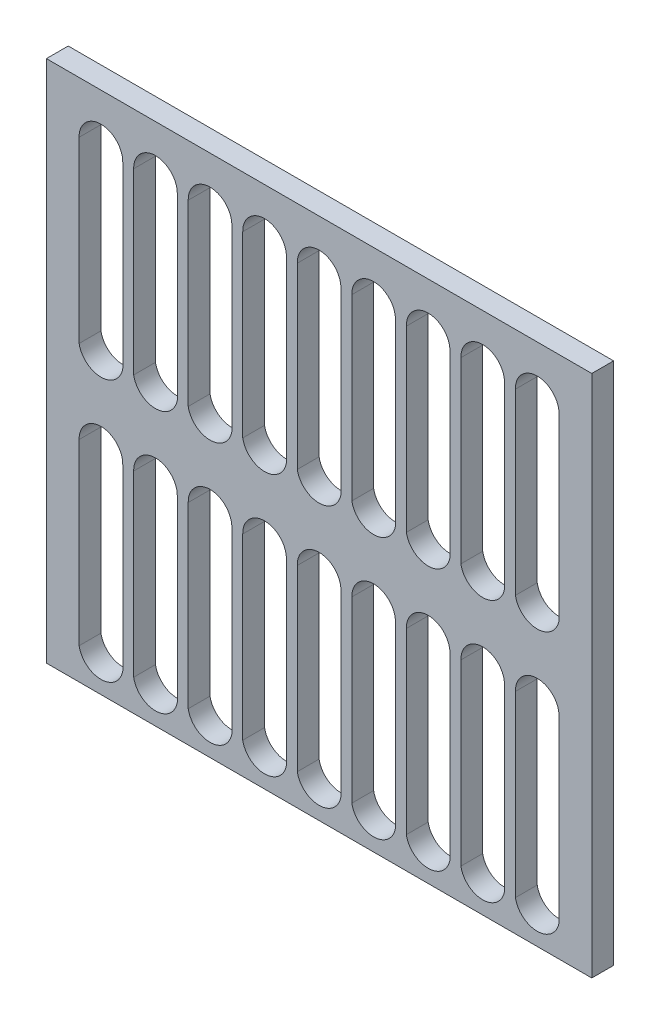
ISO-10303-21;
HEADER;
FILE_DESCRIPTION(('STEP AP214'),'2;1');
FILE_NAME('part.step','',(''),(''),'','','');
FILE_SCHEMA(('AUTOMOTIVE_DESIGN { 1 0 10303 214 1 1 1 1 }'));
ENDSEC;
DATA;
#1=APPLICATION_CONTEXT('core data for automotive mechanical design processes');
#2=APPLICATION_PROTOCOL_DEFINITION('international standard','automotive_design',2000,#1);
#3=PRODUCT_CONTEXT('',#1,'mechanical');
#4=PRODUCT('Part','Part','',(#3));
#5=PRODUCT_RELATED_PRODUCT_CATEGORY('part','',(#4));
#6=PRODUCT_DEFINITION_FORMATION('','',#4);
#7=PRODUCT_DEFINITION_CONTEXT('part definition',#1,'design');
#8=PRODUCT_DEFINITION('design','',#6,#7);
#9=PRODUCT_DEFINITION_SHAPE('','',#8);
#10=(LENGTH_UNIT() NAMED_UNIT(*) SI_UNIT(.MILLI.,.METRE.));
#11=(NAMED_UNIT(*) PLANE_ANGLE_UNIT() SI_UNIT($,.RADIAN.));
#12=(NAMED_UNIT(*) SI_UNIT($,.STERADIAN.) SOLID_ANGLE_UNIT());
#13=UNCERTAINTY_MEASURE_WITH_UNIT(LENGTH_MEASURE(1.E-05),#10,'distance_accuracy_value','');
#14=(GEOMETRIC_REPRESENTATION_CONTEXT(3) GLOBAL_UNCERTAINTY_ASSIGNED_CONTEXT((#13)) GLOBAL_UNIT_ASSIGNED_CONTEXT((#10,
#11,#12)) REPRESENTATION_CONTEXT('',''));
#15=CARTESIAN_POINT('',(0.,0.,0.));
#16=DIRECTION('',(0.,0.,1.));
#17=DIRECTION('',(1.,0.,0.));
#18=AXIS2_PLACEMENT_3D('',#15,#16,#17);
#19=CARTESIAN_POINT('',(0.,0.,10.));
#20=DIRECTION('',(0.,0.,1.));
#21=DIRECTION('',(1.,0.,0.));
#22=AXIS2_PLACEMENT_3D('',#19,#20,#21);
#23=PLANE('',#22);
#24=DIRECTION('',(0.,1.,0.));
#25=VECTOR('',#24,1.);
#26=CARTESIAN_POINT('',(125.,120.,10.));
#27=LINE('',#26,#25);
#28=CARTESIAN_POINT('',(125.,-120.,10.));
#29=VERTEX_POINT('',#28);
#30=CARTESIAN_POINT('',(125.,120.,10.));
#31=VERTEX_POINT('',#30);
#32=EDGE_CURVE('E1069',#29,#31,#27,.T.);
#33=ORIENTED_EDGE('',*,*,#32,.T.);
#34=DIRECTION('',(-1.,0.,0.));
#35=VECTOR('',#34,1.);
#36=CARTESIAN_POINT('',(-125.,120.,10.));
#37=LINE('',#36,#35);
#38=CARTESIAN_POINT('',(-125.,120.,10.));
#39=VERTEX_POINT('',#38);
#40=EDGE_CURVE('E1072',#31,#39,#37,.T.);
#41=ORIENTED_EDGE('',*,*,#40,.T.);
#42=DIRECTION('',(0.,-1.,0.));
#43=VECTOR('',#42,1.);
#44=CARTESIAN_POINT('',(-125.,120.,10.));
#45=LINE('',#44,#43);
#46=CARTESIAN_POINT('',(-125.,-120.,10.));
#47=VERTEX_POINT('',#46);
#48=EDGE_CURVE('E1075',#39,#47,#45,.T.);
#49=ORIENTED_EDGE('',*,*,#48,.T.);
#50=DIRECTION('',(1.,0.,0.));
#51=VECTOR('',#50,1.);
#52=CARTESIAN_POINT('',(-125.,-120.,10.));
#53=LINE('',#52,#51);
#54=EDGE_CURVE('E1077',#47,#29,#53,.T.);
#55=ORIENTED_EDGE('',*,*,#54,.T.);
#56=EDGE_LOOP('',(#33,#41,#49,#55));
#57=FACE_BOUND('',#56,.T.);
#58=DIRECTION('',(0.,-1.,0.));
#59=VECTOR('',#58,1.);
#60=CARTESIAN_POINT('',(-110.,-23.72,10.));
#61=LINE('',#60,#59);
#62=CARTESIAN_POINT('',(-110.,-23.72,10.));
#63=VERTEX_POINT('',#62);
#64=CARTESIAN_POINT('',(-110.,-105.6,10.));
#65=VERTEX_POINT('',#64);
#66=EDGE_CURVE('E1040',#63,#65,#61,.T.);
#67=ORIENTED_EDGE('',*,*,#66,.F.);
#68=CARTESIAN_POINT('',(-100.,-23.5197571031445,10.));
#69=DIRECTION('',(0.,0.,1.));
#70=DIRECTION('',(-1.,0.,0.));
#71=AXIS2_PLACEMENT_3D('',#68,#69,#70);
#72=CIRCLE('',#71,10.002004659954);
#73=CARTESIAN_POINT('',(-90.,-23.72,10.));
#74=VERTEX_POINT('',#73);
#75=EDGE_CURVE('E1038',#74,#63,#72,.T.);
#76=ORIENTED_EDGE('',*,*,#75,.F.);
#77=DIRECTION('',(0.,1.,0.));
#78=VECTOR('',#77,1.);
#79=CARTESIAN_POINT('',(-90.,-23.72,10.));
#80=LINE('',#79,#78);
#81=CARTESIAN_POINT('',(-90.,-105.6,10.));
#82=VERTEX_POINT('',#81);
#83=EDGE_CURVE('E1046',#82,#74,#80,.T.);
#84=ORIENTED_EDGE('',*,*,#83,.F.);
#85=CARTESIAN_POINT('',(-100.,-103.795433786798,10.));
#86=DIRECTION('',(0.,0.,1.));
#87=DIRECTION('',(1.,0.,0.));
#88=AXIS2_PLACEMENT_3D('',#85,#86,#87);
#89=CIRCLE('',#88,10.1615185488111);
#90=EDGE_CURVE('E1043',#65,#82,#89,.T.);
#91=ORIENTED_EDGE('',*,*,#90,.F.);
#92=EDGE_LOOP('',(#67,#76,#84,#91));
#93=FACE_BOUND('',#92,.T.);
#94=DIRECTION('',(0.,-1.,0.));
#95=VECTOR('',#94,1.);
#96=CARTESIAN_POINT('',(-85.,-23.72,10.));
#97=LINE('',#96,#95);
#98=CARTESIAN_POINT('',(-85.,-23.72,10.));
#99=VERTEX_POINT('',#98);
#100=CARTESIAN_POINT('',(-85.,-105.6,10.));
#101=VERTEX_POINT('',#100);
#102=EDGE_CURVE('E1009',#99,#101,#97,.T.);
#103=ORIENTED_EDGE('',*,*,#102,.F.);
#104=CARTESIAN_POINT('',(-75.,-23.5197571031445,10.));
#105=DIRECTION('',(0.,0.,1.));
#106=DIRECTION('',(-1.,0.,0.));
#107=AXIS2_PLACEMENT_3D('',#104,#105,#106);
#108=CIRCLE('',#107,10.002004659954);
#109=CARTESIAN_POINT('',(-65.,-23.72,10.));
#110=VERTEX_POINT('',#109);
#111=EDGE_CURVE('E1007',#110,#99,#108,.T.);
#112=ORIENTED_EDGE('',*,*,#111,.F.);
#113=DIRECTION('',(0.,1.,0.));
#114=VECTOR('',#113,1.);
#115=CARTESIAN_POINT('',(-65.,-23.72,10.));
#116=LINE('',#115,#114);
#117=CARTESIAN_POINT('',(-65.,-105.6,10.));
#118=VERTEX_POINT('',#117);
#119=EDGE_CURVE('E1015',#118,#110,#116,.T.);
#120=ORIENTED_EDGE('',*,*,#119,.F.);
#121=CARTESIAN_POINT('',(-75.,-103.795433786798,10.));
#122=DIRECTION('',(0.,0.,1.));
#123=DIRECTION('',(1.,0.,0.));
#124=AXIS2_PLACEMENT_3D('',#121,#122,#123);
#125=CIRCLE('',#124,10.1615185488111);
#126=EDGE_CURVE('E1012',#101,#118,#125,.T.);
#127=ORIENTED_EDGE('',*,*,#126,.F.);
#128=EDGE_LOOP('',(#103,#112,#120,#127));
#129=FACE_BOUND('',#128,.T.);
#130=DIRECTION('',(0.,-1.,0.));
#131=VECTOR('',#130,1.);
#132=CARTESIAN_POINT('',(-60.,-23.72,10.));
#133=LINE('',#132,#131);
#134=CARTESIAN_POINT('',(-60.,-23.72,10.));
#135=VERTEX_POINT('',#134);
#136=CARTESIAN_POINT('',(-60.,-105.6,10.));
#137=VERTEX_POINT('',#136);
#138=EDGE_CURVE('E978',#135,#137,#133,.T.);
#139=ORIENTED_EDGE('',*,*,#138,.F.);
#140=CARTESIAN_POINT('',(-50.,-23.5197571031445,10.));
#141=DIRECTION('',(0.,0.,1.));
#142=DIRECTION('',(-1.,0.,0.));
#143=AXIS2_PLACEMENT_3D('',#140,#141,#142);
#144=CIRCLE('',#143,10.002004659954);
#145=CARTESIAN_POINT('',(-40.,-23.72,10.));
#146=VERTEX_POINT('',#145);
#147=EDGE_CURVE('E976',#146,#135,#144,.T.);
#148=ORIENTED_EDGE('',*,*,#147,.F.);
#149=DIRECTION('',(0.,1.,0.));
#150=VECTOR('',#149,1.);
#151=CARTESIAN_POINT('',(-40.,-23.72,10.));
#152=LINE('',#151,#150);
#153=CARTESIAN_POINT('',(-40.,-105.6,10.));
#154=VERTEX_POINT('',#153);
#155=EDGE_CURVE('E984',#154,#146,#152,.T.);
#156=ORIENTED_EDGE('',*,*,#155,.F.);
#157=CARTESIAN_POINT('',(-50.,-103.795433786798,10.));
#158=DIRECTION('',(0.,0.,1.));
#159=DIRECTION('',(1.,0.,0.));
#160=AXIS2_PLACEMENT_3D('',#157,#158,#159);
#161=CIRCLE('',#160,10.1615185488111);
#162=EDGE_CURVE('E981',#137,#154,#161,.T.);
#163=ORIENTED_EDGE('',*,*,#162,.F.);
#164=EDGE_LOOP('',(#139,#148,#156,#163));
#165=FACE_BOUND('',#164,.T.);
#166=DIRECTION('',(0.,-1.,0.));
#167=VECTOR('',#166,1.);
#168=CARTESIAN_POINT('',(-35.,-23.72,10.));
#169=LINE('',#168,#167);
#170=CARTESIAN_POINT('',(-35.,-23.72,10.));
#171=VERTEX_POINT('',#170);
#172=CARTESIAN_POINT('',(-35.,-105.6,10.));
#173=VERTEX_POINT('',#172);
#174=EDGE_CURVE('E947',#171,#173,#169,.T.);
#175=ORIENTED_EDGE('',*,*,#174,.F.);
#176=CARTESIAN_POINT('',(-25.,-23.5197571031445,10.));
#177=DIRECTION('',(0.,0.,1.));
#178=DIRECTION('',(-1.,0.,0.));
#179=AXIS2_PLACEMENT_3D('',#176,#177,#178);
#180=CIRCLE('',#179,10.002004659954);
#181=CARTESIAN_POINT('',(-15.,-23.72,10.));
#182=VERTEX_POINT('',#181);
#183=EDGE_CURVE('E945',#182,#171,#180,.T.);
#184=ORIENTED_EDGE('',*,*,#183,.F.);
#185=DIRECTION('',(0.,1.,0.));
#186=VECTOR('',#185,1.);
#187=CARTESIAN_POINT('',(-15.,-23.72,10.));
#188=LINE('',#187,#186);
#189=CARTESIAN_POINT('',(-15.,-105.6,10.));
#190=VERTEX_POINT('',#189);
#191=EDGE_CURVE('E953',#190,#182,#188,.T.);
#192=ORIENTED_EDGE('',*,*,#191,.F.);
#193=CARTESIAN_POINT('',(-25.,-103.795433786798,10.));
#194=DIRECTION('',(0.,0.,1.));
#195=DIRECTION('',(1.,0.,0.));
#196=AXIS2_PLACEMENT_3D('',#193,#194,#195);
#197=CIRCLE('',#196,10.1615185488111);
#198=EDGE_CURVE('E950',#173,#190,#197,.T.);
#199=ORIENTED_EDGE('',*,*,#198,.F.);
#200=EDGE_LOOP('',(#175,#184,#192,#199));
#201=FACE_BOUND('',#200,.T.);
#202=DIRECTION('',(0.,-1.,0.));
#203=VECTOR('',#202,1.);
#204=CARTESIAN_POINT('',(-10.,-23.72,10.));
#205=LINE('',#204,#203);
#206=CARTESIAN_POINT('',(-10.,-23.72,10.));
#207=VERTEX_POINT('',#206);
#208=CARTESIAN_POINT('',(-9.99999999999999,-105.6,10.));
#209=VERTEX_POINT('',#208);
#210=EDGE_CURVE('E916',#207,#209,#205,.T.);
#211=ORIENTED_EDGE('',*,*,#210,.F.);
#212=CARTESIAN_POINT('',(0.,-23.5197571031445,10.));
#213=DIRECTION('',(0.,0.,1.));
#214=DIRECTION('',(-1.,0.,0.));
#215=AXIS2_PLACEMENT_3D('',#212,#213,#214);
#216=CIRCLE('',#215,10.002004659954);
#217=CARTESIAN_POINT('',(9.99999999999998,-23.72,10.));
#218=VERTEX_POINT('',#217);
#219=EDGE_CURVE('E914',#218,#207,#216,.T.);
#220=ORIENTED_EDGE('',*,*,#219,.F.);
#221=DIRECTION('',(0.,1.,0.));
#222=VECTOR('',#221,1.);
#223=CARTESIAN_POINT('',(9.99999999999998,-23.72,10.));
#224=LINE('',#223,#222);
#225=CARTESIAN_POINT('',(9.99999999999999,-105.6,10.));
#226=VERTEX_POINT('',#225);
#227=EDGE_CURVE('E922',#226,#218,#224,.T.);
#228=ORIENTED_EDGE('',*,*,#227,.F.);
#229=CARTESIAN_POINT('',(0.,-103.795433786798,10.));
#230=DIRECTION('',(0.,0.,1.));
#231=DIRECTION('',(1.,0.,0.));
#232=AXIS2_PLACEMENT_3D('',#229,#230,#231);
#233=CIRCLE('',#232,10.1615185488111);
#234=EDGE_CURVE('E919',#209,#226,#233,.T.);
#235=ORIENTED_EDGE('',*,*,#234,.F.);
#236=EDGE_LOOP('',(#211,#220,#228,#235));
#237=FACE_BOUND('',#236,.T.);
#238=DIRECTION('',(0.,-1.,0.));
#239=VECTOR('',#238,1.);
#240=CARTESIAN_POINT('',(15.,-23.72,10.));
#241=LINE('',#240,#239);
#242=CARTESIAN_POINT('',(15.,-23.72,10.));
#243=VERTEX_POINT('',#242);
#244=CARTESIAN_POINT('',(15.,-105.6,10.));
#245=VERTEX_POINT('',#244);
#246=EDGE_CURVE('E885',#243,#245,#241,.T.);
#247=ORIENTED_EDGE('',*,*,#246,.F.);
#248=CARTESIAN_POINT('',(25.,-23.5197571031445,10.));
#249=DIRECTION('',(0.,0.,1.));
#250=DIRECTION('',(-1.,0.,0.));
#251=AXIS2_PLACEMENT_3D('',#248,#249,#250);
#252=CIRCLE('',#251,10.002004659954);
#253=CARTESIAN_POINT('',(35.,-23.72,10.));
#254=VERTEX_POINT('',#253);
#255=EDGE_CURVE('E883',#254,#243,#252,.T.);
#256=ORIENTED_EDGE('',*,*,#255,.F.);
#257=DIRECTION('',(0.,1.,0.));
#258=VECTOR('',#257,1.);
#259=CARTESIAN_POINT('',(35.,-23.72,10.));
#260=LINE('',#259,#258);
#261=CARTESIAN_POINT('',(35.,-105.6,10.));
#262=VERTEX_POINT('',#261);
#263=EDGE_CURVE('E891',#262,#254,#260,.T.);
#264=ORIENTED_EDGE('',*,*,#263,.F.);
#265=CARTESIAN_POINT('',(25.,-103.795433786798,10.));
#266=DIRECTION('',(0.,0.,1.));
#267=DIRECTION('',(1.,0.,0.));
#268=AXIS2_PLACEMENT_3D('',#265,#266,#267);
#269=CIRCLE('',#268,10.1615185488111);
#270=EDGE_CURVE('E888',#245,#262,#269,.T.);
#271=ORIENTED_EDGE('',*,*,#270,.F.);
#272=EDGE_LOOP('',(#247,#256,#264,#271));
#273=FACE_BOUND('',#272,.T.);
#274=DIRECTION('',(0.,-1.,0.));
#275=VECTOR('',#274,1.);
#276=CARTESIAN_POINT('',(40.,-23.72,10.));
#277=LINE('',#276,#275);
#278=CARTESIAN_POINT('',(40.,-23.72,10.));
#279=VERTEX_POINT('',#278);
#280=CARTESIAN_POINT('',(40.,-105.6,10.));
#281=VERTEX_POINT('',#280);
#282=EDGE_CURVE('E854',#279,#281,#277,.T.);
#283=ORIENTED_EDGE('',*,*,#282,.F.);
#284=CARTESIAN_POINT('',(50.,-23.5197571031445,10.));
#285=DIRECTION('',(0.,0.,1.));
#286=DIRECTION('',(-1.,0.,0.));
#287=AXIS2_PLACEMENT_3D('',#284,#285,#286);
#288=CIRCLE('',#287,10.002004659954);
#289=CARTESIAN_POINT('',(60.,-23.72,10.));
#290=VERTEX_POINT('',#289);
#291=EDGE_CURVE('E852',#290,#279,#288,.T.);
#292=ORIENTED_EDGE('',*,*,#291,.F.);
#293=DIRECTION('',(0.,1.,0.));
#294=VECTOR('',#293,1.);
#295=CARTESIAN_POINT('',(60.,-23.72,10.));
#296=LINE('',#295,#294);
#297=CARTESIAN_POINT('',(60.,-105.6,10.));
#298=VERTEX_POINT('',#297);
#299=EDGE_CURVE('E860',#298,#290,#296,.T.);
#300=ORIENTED_EDGE('',*,*,#299,.F.);
#301=CARTESIAN_POINT('',(50.,-103.795433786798,10.));
#302=DIRECTION('',(0.,0.,1.));
#303=DIRECTION('',(1.,0.,0.));
#304=AXIS2_PLACEMENT_3D('',#301,#302,#303);
#305=CIRCLE('',#304,10.1615185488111);
#306=EDGE_CURVE('E857',#281,#298,#305,.T.);
#307=ORIENTED_EDGE('',*,*,#306,.F.);
#308=EDGE_LOOP('',(#283,#292,#300,#307));
#309=FACE_BOUND('',#308,.T.);
#310=DIRECTION('',(0.,-1.,0.));
#311=VECTOR('',#310,1.);
#312=CARTESIAN_POINT('',(65.,-23.72,10.));
#313=LINE('',#312,#311);
#314=CARTESIAN_POINT('',(65.,-23.72,10.));
#315=VERTEX_POINT('',#314);
#316=CARTESIAN_POINT('',(65.,-105.6,10.));
#317=VERTEX_POINT('',#316);
#318=EDGE_CURVE('E823',#315,#317,#313,.T.);
#319=ORIENTED_EDGE('',*,*,#318,.F.);
#320=CARTESIAN_POINT('',(75.,-23.5197571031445,10.));
#321=DIRECTION('',(0.,0.,1.));
#322=DIRECTION('',(-1.,0.,0.));
#323=AXIS2_PLACEMENT_3D('',#320,#321,#322);
#324=CIRCLE('',#323,10.002004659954);
#325=CARTESIAN_POINT('',(85.,-23.72,10.));
#326=VERTEX_POINT('',#325);
#327=EDGE_CURVE('E821',#326,#315,#324,.T.);
#328=ORIENTED_EDGE('',*,*,#327,.F.);
#329=DIRECTION('',(0.,1.,0.));
#330=VECTOR('',#329,1.);
#331=CARTESIAN_POINT('',(85.,-23.72,10.));
#332=LINE('',#331,#330);
#333=CARTESIAN_POINT('',(85.,-105.6,10.));
#334=VERTEX_POINT('',#333);
#335=EDGE_CURVE('E829',#334,#326,#332,.T.);
#336=ORIENTED_EDGE('',*,*,#335,.F.);
#337=CARTESIAN_POINT('',(75.,-103.795433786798,10.));
#338=DIRECTION('',(0.,0.,1.));
#339=DIRECTION('',(1.,0.,0.));
#340=AXIS2_PLACEMENT_3D('',#337,#338,#339);
#341=CIRCLE('',#340,10.1615185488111);
#342=EDGE_CURVE('E826',#317,#334,#341,.T.);
#343=ORIENTED_EDGE('',*,*,#342,.F.);
#344=EDGE_LOOP('',(#319,#328,#336,#343));
#345=FACE_BOUND('',#344,.T.);
#346=DIRECTION('',(0.,-1.,0.));
#347=VECTOR('',#346,1.);
#348=CARTESIAN_POINT('',(90.,-23.72,10.));
#349=LINE('',#348,#347);
#350=CARTESIAN_POINT('',(90.,-23.72,10.));
#351=VERTEX_POINT('',#350);
#352=CARTESIAN_POINT('',(90.,-105.6,10.));
#353=VERTEX_POINT('',#352);
#354=EDGE_CURVE('E792',#351,#353,#349,.T.);
#355=ORIENTED_EDGE('',*,*,#354,.F.);
#356=CARTESIAN_POINT('',(100.,-23.5197571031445,10.));
#357=DIRECTION('',(0.,0.,1.));
#358=DIRECTION('',(-1.,0.,0.));
#359=AXIS2_PLACEMENT_3D('',#356,#357,#358);
#360=CIRCLE('',#359,10.002004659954);
#361=CARTESIAN_POINT('',(110.,-23.72,10.));
#362=VERTEX_POINT('',#361);
#363=EDGE_CURVE('E790',#362,#351,#360,.T.);
#364=ORIENTED_EDGE('',*,*,#363,.F.);
#365=DIRECTION('',(0.,1.,0.));
#366=VECTOR('',#365,1.);
#367=CARTESIAN_POINT('',(110.,-23.72,10.));
#368=LINE('',#367,#366);
#369=CARTESIAN_POINT('',(110.,-105.6,10.));
#370=VERTEX_POINT('',#369);
#371=EDGE_CURVE('E798',#370,#362,#368,.T.);
#372=ORIENTED_EDGE('',*,*,#371,.F.);
#373=CARTESIAN_POINT('',(100.,-103.795433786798,10.));
#374=DIRECTION('',(0.,0.,1.));
#375=DIRECTION('',(1.,0.,0.));
#376=AXIS2_PLACEMENT_3D('',#373,#374,#375);
#377=CIRCLE('',#376,10.1615185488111);
#378=EDGE_CURVE('E795',#353,#370,#377,.T.);
#379=ORIENTED_EDGE('',*,*,#378,.F.);
#380=EDGE_LOOP('',(#355,#364,#372,#379));
#381=FACE_BOUND('',#380,.T.);
#382=DIRECTION('',(0.,-1.,0.));
#383=VECTOR('',#382,1.);
#384=CARTESIAN_POINT('',(-85.0000000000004,96.28,10.));
#385=LINE('',#384,#383);
#386=CARTESIAN_POINT('',(-85.0000000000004,96.28,10.));
#387=VERTEX_POINT('',#386);
#388=CARTESIAN_POINT('',(-85.0000000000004,14.4,10.));
#389=VERTEX_POINT('',#388);
#390=EDGE_CURVE('E761',#387,#389,#385,.T.);
#391=ORIENTED_EDGE('',*,*,#390,.F.);
#392=CARTESIAN_POINT('',(-75.0000000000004,96.4802428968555,10.));
#393=DIRECTION('',(0.,0.,1.));
#394=DIRECTION('',(-1.,0.,0.));
#395=AXIS2_PLACEMENT_3D('',#392,#393,#394);
#396=CIRCLE('',#395,10.002004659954);
#397=CARTESIAN_POINT('',(-65.0000000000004,96.28,10.));
#398=VERTEX_POINT('',#397);
#399=EDGE_CURVE('E759',#398,#387,#396,.T.);
#400=ORIENTED_EDGE('',*,*,#399,.F.);
#401=DIRECTION('',(0.,1.,0.));
#402=VECTOR('',#401,1.);
#403=CARTESIAN_POINT('',(-65.0000000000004,96.28,10.));
#404=LINE('',#403,#402);
#405=CARTESIAN_POINT('',(-65.0000000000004,14.4,10.));
#406=VERTEX_POINT('',#405);
#407=EDGE_CURVE('E767',#406,#398,#404,.T.);
#408=ORIENTED_EDGE('',*,*,#407,.F.);
#409=CARTESIAN_POINT('',(-75.0000000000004,16.2045662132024,10.));
#410=DIRECTION('',(0.,0.,1.));
#411=DIRECTION('',(1.,0.,0.));
#412=AXIS2_PLACEMENT_3D('',#409,#410,#411);
#413=CIRCLE('',#412,10.1615185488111);
#414=EDGE_CURVE('E764',#389,#406,#413,.T.);
#415=ORIENTED_EDGE('',*,*,#414,.F.);
#416=EDGE_LOOP('',(#391,#400,#408,#415));
#417=FACE_BOUND('',#416,.T.);
#418=DIRECTION('',(0.,-1.,0.));
#419=VECTOR('',#418,1.);
#420=CARTESIAN_POINT('',(-60.0000000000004,96.28,10.));
#421=LINE('',#420,#419);
#422=CARTESIAN_POINT('',(-60.0000000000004,96.28,10.));
#423=VERTEX_POINT('',#422);
#424=CARTESIAN_POINT('',(-60.0000000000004,14.4,10.));
#425=VERTEX_POINT('',#424);
#426=EDGE_CURVE('E730',#423,#425,#421,.T.);
#427=ORIENTED_EDGE('',*,*,#426,.F.);
#428=CARTESIAN_POINT('',(-50.0000000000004,96.4802428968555,10.));
#429=DIRECTION('',(0.,0.,1.));
#430=DIRECTION('',(-1.,0.,0.));
#431=AXIS2_PLACEMENT_3D('',#428,#429,#430);
#432=CIRCLE('',#431,10.002004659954);
#433=CARTESIAN_POINT('',(-40.0000000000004,96.28,10.));
#434=VERTEX_POINT('',#433);
#435=EDGE_CURVE('E728',#434,#423,#432,.T.);
#436=ORIENTED_EDGE('',*,*,#435,.F.);
#437=DIRECTION('',(0.,1.,0.));
#438=VECTOR('',#437,1.);
#439=CARTESIAN_POINT('',(-40.0000000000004,96.28,10.));
#440=LINE('',#439,#438);
#441=CARTESIAN_POINT('',(-40.0000000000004,14.4,10.));
#442=VERTEX_POINT('',#441);
#443=EDGE_CURVE('E736',#442,#434,#440,.T.);
#444=ORIENTED_EDGE('',*,*,#443,.F.);
#445=CARTESIAN_POINT('',(-50.0000000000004,16.2045662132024,10.));
#446=DIRECTION('',(0.,0.,1.));
#447=DIRECTION('',(1.,0.,0.));
#448=AXIS2_PLACEMENT_3D('',#445,#446,#447);
#449=CIRCLE('',#448,10.1615185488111);
#450=EDGE_CURVE('E733',#425,#442,#449,.T.);
#451=ORIENTED_EDGE('',*,*,#450,.F.);
#452=EDGE_LOOP('',(#427,#436,#444,#451));
#453=FACE_BOUND('',#452,.T.);
#454=DIRECTION('',(0.,-1.,0.));
#455=VECTOR('',#454,1.);
#456=CARTESIAN_POINT('',(-35.0000000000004,96.28,10.));
#457=LINE('',#456,#455);
#458=CARTESIAN_POINT('',(-35.0000000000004,96.28,10.));
#459=VERTEX_POINT('',#458);
#460=CARTESIAN_POINT('',(-35.0000000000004,14.4,10.));
#461=VERTEX_POINT('',#460);
#462=EDGE_CURVE('E699',#459,#461,#457,.T.);
#463=ORIENTED_EDGE('',*,*,#462,.F.);
#464=CARTESIAN_POINT('',(-25.0000000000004,96.4802428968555,10.));
#465=DIRECTION('',(0.,0.,1.));
#466=DIRECTION('',(-1.,0.,0.));
#467=AXIS2_PLACEMENT_3D('',#464,#465,#466);
#468=CIRCLE('',#467,10.002004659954);
#469=CARTESIAN_POINT('',(-15.0000000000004,96.28,10.));
#470=VERTEX_POINT('',#469);
#471=EDGE_CURVE('E697',#470,#459,#468,.T.);
#472=ORIENTED_EDGE('',*,*,#471,.F.);
#473=DIRECTION('',(0.,1.,0.));
#474=VECTOR('',#473,1.);
#475=CARTESIAN_POINT('',(-15.0000000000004,96.28,10.));
#476=LINE('',#475,#474);
#477=CARTESIAN_POINT('',(-15.0000000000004,14.4,10.));
#478=VERTEX_POINT('',#477);
#479=EDGE_CURVE('E705',#478,#470,#476,.T.);
#480=ORIENTED_EDGE('',*,*,#479,.F.);
#481=CARTESIAN_POINT('',(-25.0000000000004,16.2045662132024,10.));
#482=DIRECTION('',(0.,0.,1.));
#483=DIRECTION('',(1.,0.,0.));
#484=AXIS2_PLACEMENT_3D('',#481,#482,#483);
#485=CIRCLE('',#484,10.1615185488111);
#486=EDGE_CURVE('E702',#461,#478,#485,.T.);
#487=ORIENTED_EDGE('',*,*,#486,.F.);
#488=EDGE_LOOP('',(#463,#472,#480,#487));
#489=FACE_BOUND('',#488,.T.);
#490=DIRECTION('',(0.,-1.,0.));
#491=VECTOR('',#490,1.);
#492=CARTESIAN_POINT('',(-10.0000000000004,96.28,10.));
#493=LINE('',#492,#491);
#494=CARTESIAN_POINT('',(-10.0000000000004,96.28,10.));
#495=VERTEX_POINT('',#494);
#496=CARTESIAN_POINT('',(-10.0000000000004,14.4,10.));
#497=VERTEX_POINT('',#496);
#498=EDGE_CURVE('E668',#495,#497,#493,.T.);
#499=ORIENTED_EDGE('',*,*,#498,.F.);
#500=CARTESIAN_POINT('',(-4.30211422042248E-13,96.4802428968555,10.));
#501=DIRECTION('',(0.,0.,1.));
#502=DIRECTION('',(-1.,0.,0.));
#503=AXIS2_PLACEMENT_3D('',#500,#501,#502);
#504=CIRCLE('',#503,10.002004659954);
#505=CARTESIAN_POINT('',(9.99999999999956,96.28,10.));
#506=VERTEX_POINT('',#505);
#507=EDGE_CURVE('E666',#506,#495,#504,.T.);
#508=ORIENTED_EDGE('',*,*,#507,.F.);
#509=DIRECTION('',(0.,1.,0.));
#510=VECTOR('',#509,1.);
#511=CARTESIAN_POINT('',(9.99999999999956,96.28,10.));
#512=LINE('',#511,#510);
#513=CARTESIAN_POINT('',(9.99999999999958,14.4,10.));
#514=VERTEX_POINT('',#513);
#515=EDGE_CURVE('E674',#514,#506,#512,.T.);
#516=ORIENTED_EDGE('',*,*,#515,.F.);
#517=CARTESIAN_POINT('',(-4.16333634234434E-13,16.2045662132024,10.));
#518=DIRECTION('',(0.,0.,1.));
#519=DIRECTION('',(1.,0.,0.));
#520=AXIS2_PLACEMENT_3D('',#517,#518,#519);
#521=CIRCLE('',#520,10.1615185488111);
#522=EDGE_CURVE('E671',#497,#514,#521,.T.);
#523=ORIENTED_EDGE('',*,*,#522,.F.);
#524=EDGE_LOOP('',(#499,#508,#516,#523));
#525=FACE_BOUND('',#524,.T.);
#526=DIRECTION('',(0.,-1.,0.));
#527=VECTOR('',#526,1.);
#528=CARTESIAN_POINT('',(14.9999999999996,96.28,10.));
#529=LINE('',#528,#527);
#530=CARTESIAN_POINT('',(14.9999999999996,96.28,10.));
#531=VERTEX_POINT('',#530);
#532=CARTESIAN_POINT('',(14.9999999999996,14.4,10.));
#533=VERTEX_POINT('',#532);
#534=EDGE_CURVE('E637',#531,#533,#529,.T.);
#535=ORIENTED_EDGE('',*,*,#534,.F.);
#536=CARTESIAN_POINT('',(24.9999999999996,96.4802428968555,10.));
#537=DIRECTION('',(0.,0.,1.));
#538=DIRECTION('',(-1.,0.,0.));
#539=AXIS2_PLACEMENT_3D('',#536,#537,#538);
#540=CIRCLE('',#539,10.002004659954);
#541=CARTESIAN_POINT('',(34.9999999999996,96.28,10.));
#542=VERTEX_POINT('',#541);
#543=EDGE_CURVE('E635',#542,#531,#540,.T.);
#544=ORIENTED_EDGE('',*,*,#543,.F.);
#545=DIRECTION('',(0.,1.,0.));
#546=VECTOR('',#545,1.);
#547=CARTESIAN_POINT('',(34.9999999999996,96.28,10.));
#548=LINE('',#547,#546);
#549=CARTESIAN_POINT('',(34.9999999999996,14.4,10.));
#550=VERTEX_POINT('',#549);
#551=EDGE_CURVE('E643',#550,#542,#548,.T.);
#552=ORIENTED_EDGE('',*,*,#551,.F.);
#553=CARTESIAN_POINT('',(24.9999999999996,16.2045662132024,10.));
#554=DIRECTION('',(0.,0.,1.));
#555=DIRECTION('',(1.,0.,0.));
#556=AXIS2_PLACEMENT_3D('',#553,#554,#555);
#557=CIRCLE('',#556,10.1615185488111);
#558=EDGE_CURVE('E640',#533,#550,#557,.T.);
#559=ORIENTED_EDGE('',*,*,#558,.F.);
#560=EDGE_LOOP('',(#535,#544,#552,#559));
#561=FACE_BOUND('',#560,.T.);
#562=DIRECTION('',(0.,-1.,0.));
#563=VECTOR('',#562,1.);
#564=CARTESIAN_POINT('',(39.9999999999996,96.28,10.));
#565=LINE('',#564,#563);
#566=CARTESIAN_POINT('',(39.9999999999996,96.28,10.));
#567=VERTEX_POINT('',#566);
#568=CARTESIAN_POINT('',(39.9999999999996,14.4,10.));
#569=VERTEX_POINT('',#568);
#570=EDGE_CURVE('E606',#567,#569,#565,.T.);
#571=ORIENTED_EDGE('',*,*,#570,.F.);
#572=CARTESIAN_POINT('',(49.9999999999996,96.4802428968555,10.));
#573=DIRECTION('',(0.,0.,1.));
#574=DIRECTION('',(-1.,0.,0.));
#575=AXIS2_PLACEMENT_3D('',#572,#573,#574);
#576=CIRCLE('',#575,10.002004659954);
#577=CARTESIAN_POINT('',(59.9999999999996,96.28,10.));
#578=VERTEX_POINT('',#577);
#579=EDGE_CURVE('E604',#578,#567,#576,.T.);
#580=ORIENTED_EDGE('',*,*,#579,.F.);
#581=DIRECTION('',(0.,1.,0.));
#582=VECTOR('',#581,1.);
#583=CARTESIAN_POINT('',(59.9999999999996,96.28,10.));
#584=LINE('',#583,#582);
#585=CARTESIAN_POINT('',(59.9999999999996,14.4,10.));
#586=VERTEX_POINT('',#585);
#587=EDGE_CURVE('E612',#586,#578,#584,.T.);
#588=ORIENTED_EDGE('',*,*,#587,.F.);
#589=CARTESIAN_POINT('',(49.9999999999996,16.2045662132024,10.));
#590=DIRECTION('',(0.,0.,1.));
#591=DIRECTION('',(1.,0.,0.));
#592=AXIS2_PLACEMENT_3D('',#589,#590,#591);
#593=CIRCLE('',#592,10.1615185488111);
#594=EDGE_CURVE('E609',#569,#586,#593,.T.);
#595=ORIENTED_EDGE('',*,*,#594,.F.);
#596=EDGE_LOOP('',(#571,#580,#588,#595));
#597=FACE_BOUND('',#596,.T.);
#598=DIRECTION('',(0.,-1.,0.));
#599=VECTOR('',#598,1.);
#600=CARTESIAN_POINT('',(64.9999999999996,96.28,10.));
#601=LINE('',#600,#599);
#602=CARTESIAN_POINT('',(64.9999999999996,96.28,10.));
#603=VERTEX_POINT('',#602);
#604=CARTESIAN_POINT('',(64.9999999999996,14.4,10.));
#605=VERTEX_POINT('',#604);
#606=EDGE_CURVE('E575',#603,#605,#601,.T.);
#607=ORIENTED_EDGE('',*,*,#606,.F.);
#608=CARTESIAN_POINT('',(74.9999999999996,96.4802428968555,10.));
#609=DIRECTION('',(0.,0.,1.));
#610=DIRECTION('',(-1.,0.,0.));
#611=AXIS2_PLACEMENT_3D('',#608,#609,#610);
#612=CIRCLE('',#611,10.002004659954);
#613=CARTESIAN_POINT('',(84.9999999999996,96.28,10.));
#614=VERTEX_POINT('',#613);
#615=EDGE_CURVE('E573',#614,#603,#612,.T.);
#616=ORIENTED_EDGE('',*,*,#615,.F.);
#617=DIRECTION('',(0.,1.,0.));
#618=VECTOR('',#617,1.);
#619=CARTESIAN_POINT('',(84.9999999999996,96.28,10.));
#620=LINE('',#619,#618);
#621=CARTESIAN_POINT('',(84.9999999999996,14.4,10.));
#622=VERTEX_POINT('',#621);
#623=EDGE_CURVE('E581',#622,#614,#620,.T.);
#624=ORIENTED_EDGE('',*,*,#623,.F.);
#625=CARTESIAN_POINT('',(74.9999999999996,16.2045662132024,10.));
#626=DIRECTION('',(0.,0.,1.));
#627=DIRECTION('',(1.,0.,0.));
#628=AXIS2_PLACEMENT_3D('',#625,#626,#627);
#629=CIRCLE('',#628,10.1615185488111);
#630=EDGE_CURVE('E578',#605,#622,#629,.T.);
#631=ORIENTED_EDGE('',*,*,#630,.F.);
#632=EDGE_LOOP('',(#607,#616,#624,#631));
#633=FACE_BOUND('',#632,.T.);
#634=DIRECTION('',(0.,-1.,0.));
#635=VECTOR('',#634,1.);
#636=CARTESIAN_POINT('',(89.9999999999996,96.28,10.));
#637=LINE('',#636,#635);
#638=CARTESIAN_POINT('',(89.9999999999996,96.28,10.));
#639=VERTEX_POINT('',#638);
#640=CARTESIAN_POINT('',(89.9999999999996,14.4,10.));
#641=VERTEX_POINT('',#640);
#642=EDGE_CURVE('E544',#639,#641,#637,.T.);
#643=ORIENTED_EDGE('',*,*,#642,.F.);
#644=CARTESIAN_POINT('',(99.9999999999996,96.4802428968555,10.));
#645=DIRECTION('',(0.,0.,1.));
#646=DIRECTION('',(-1.,0.,0.));
#647=AXIS2_PLACEMENT_3D('',#644,#645,#646);
#648=CIRCLE('',#647,10.002004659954);
#649=CARTESIAN_POINT('',(110.,96.28,10.));
#650=VERTEX_POINT('',#649);
#651=EDGE_CURVE('E542',#650,#639,#648,.T.);
#652=ORIENTED_EDGE('',*,*,#651,.F.);
#653=DIRECTION('',(0.,1.,0.));
#654=VECTOR('',#653,1.);
#655=CARTESIAN_POINT('',(110.,96.28,10.));
#656=LINE('',#655,#654);
#657=CARTESIAN_POINT('',(110.,14.4,10.));
#658=VERTEX_POINT('',#657);
#659=EDGE_CURVE('E550',#658,#650,#656,.T.);
#660=ORIENTED_EDGE('',*,*,#659,.F.);
#661=CARTESIAN_POINT('',(99.9999999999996,16.2045662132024,10.));
#662=DIRECTION('',(0.,0.,1.));
#663=DIRECTION('',(1.,0.,0.));
#664=AXIS2_PLACEMENT_3D('',#661,#662,#663);
#665=CIRCLE('',#664,10.1615185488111);
#666=EDGE_CURVE('E547',#641,#658,#665,.T.);
#667=ORIENTED_EDGE('',*,*,#666,.F.);
#668=EDGE_LOOP('',(#643,#652,#660,#667));
#669=FACE_BOUND('',#668,.T.);
#670=DIRECTION('',(0.,-1.,0.));
#671=VECTOR('',#670,1.);
#672=CARTESIAN_POINT('',(-110.,96.28,10.));
#673=LINE('',#672,#671);
#674=CARTESIAN_POINT('',(-110.,96.28,10.));
#675=VERTEX_POINT('',#674);
#676=CARTESIAN_POINT('',(-110.,14.4,10.));
#677=VERTEX_POINT('',#676);
#678=EDGE_CURVE('E514',#675,#677,#673,.T.);
#679=ORIENTED_EDGE('',*,*,#678,.F.);
#680=CARTESIAN_POINT('',(-100.,96.4802428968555,10.));
#681=DIRECTION('',(0.,0.,1.));
#682=DIRECTION('',(-1.,0.,0.));
#683=AXIS2_PLACEMENT_3D('',#680,#681,#682);
#684=CIRCLE('',#683,10.002004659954);
#685=CARTESIAN_POINT('',(-90.0000000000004,96.28,10.));
#686=VERTEX_POINT('',#685);
#687=EDGE_CURVE('E506',#686,#675,#684,.T.);
#688=ORIENTED_EDGE('',*,*,#687,.F.);
#689=DIRECTION('',(0.,1.,0.));
#690=VECTOR('',#689,1.);
#691=CARTESIAN_POINT('',(-90.0000000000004,96.28,10.));
#692=LINE('',#691,#690);
#693=CARTESIAN_POINT('',(-90.0000000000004,14.4,10.));
#694=VERTEX_POINT('',#693);
#695=EDGE_CURVE('E528',#694,#686,#692,.T.);
#696=ORIENTED_EDGE('',*,*,#695,.F.);
#697=CARTESIAN_POINT('',(-100.,16.2045662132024,10.));
#698=DIRECTION('',(0.,0.,1.));
#699=DIRECTION('',(1.,0.,0.));
#700=AXIS2_PLACEMENT_3D('',#697,#698,#699);
#701=CIRCLE('',#700,10.1615185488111);
#702=EDGE_CURVE('E526',#677,#694,#701,.T.);
#703=ORIENTED_EDGE('',*,*,#702,.F.);
#704=EDGE_LOOP('',(#679,#688,#696,#703));
#705=FACE_BOUND('',#704,.T.);
#706=ADVANCED_FACE('F33',(#57,#93,#129,#165,#201,#237,#273,#309,#345,#381,#417,#453,#489,#525,
#561,#597,#633,#669,#705),#23,.T.);
#707=CARTESIAN_POINT('',(0.,0.,0.));
#708=DIRECTION('',(0.,0.,1.));
#709=DIRECTION('',(1.,0.,0.));
#710=AXIS2_PLACEMENT_3D('',#707,#708,#709);
#711=PLANE('',#710);
#712=CARTESIAN_POINT('',(99.9999999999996,96.4802428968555,0.));
#713=DIRECTION('',(0.,0.,1.));
#714=DIRECTION('',(-1.,0.,0.));
#715=AXIS2_PLACEMENT_3D('',#712,#713,#714);
#716=CIRCLE('',#715,10.002004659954);
#717=CARTESIAN_POINT('',(110.,96.28,0.));
#718=VERTEX_POINT('',#717);
#719=CARTESIAN_POINT('',(89.9999999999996,96.28,0.));
#720=VERTEX_POINT('',#719);
#721=EDGE_CURVE('E522',#718,#720,#716,.T.);
#722=ORIENTED_EDGE('',*,*,#721,.T.);
#723=DIRECTION('',(0.,-1.,0.));
#724=VECTOR('',#723,1.);
#725=CARTESIAN_POINT('',(89.9999999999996,96.28,0.));
#726=LINE('',#725,#724);
#727=CARTESIAN_POINT('',(89.9999999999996,14.4,0.));
#728=VERTEX_POINT('',#727);
#729=EDGE_CURVE('E555',#720,#728,#726,.T.);
#730=ORIENTED_EDGE('',*,*,#729,.T.);
#731=CARTESIAN_POINT('',(99.9999999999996,16.2045662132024,0.));
#732=DIRECTION('',(0.,0.,1.));
#733=DIRECTION('',(1.,0.,0.));
#734=AXIS2_PLACEMENT_3D('',#731,#732,#733);
#735=CIRCLE('',#734,10.1615185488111);
#736=CARTESIAN_POINT('',(110.,14.4,0.));
#737=VERTEX_POINT('',#736);
#738=EDGE_CURVE('E558',#728,#737,#735,.T.);
#739=ORIENTED_EDGE('',*,*,#738,.T.);
#740=DIRECTION('',(0.,1.,0.));
#741=VECTOR('',#740,1.);
#742=CARTESIAN_POINT('',(110.,96.28,0.));
#743=LINE('',#742,#741);
#744=EDGE_CURVE('E545',#737,#718,#743,.T.);
#745=ORIENTED_EDGE('',*,*,#744,.T.);
#746=EDGE_LOOP('',(#722,#730,#739,#745));
#747=FACE_BOUND('',#746,.T.);
#748=CARTESIAN_POINT('',(49.9999999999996,96.4802428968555,0.));
#749=DIRECTION('',(0.,0.,1.));
#750=DIRECTION('',(-1.,0.,0.));
#751=AXIS2_PLACEMENT_3D('',#748,#749,#750);
#752=CIRCLE('',#751,10.002004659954);
#753=CARTESIAN_POINT('',(59.9999999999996,96.28,0.));
#754=VERTEX_POINT('',#753);
#755=CARTESIAN_POINT('',(39.9999999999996,96.28,0.));
#756=VERTEX_POINT('',#755);
#757=EDGE_CURVE('E603',#754,#756,#752,.T.);
#758=ORIENTED_EDGE('',*,*,#757,.T.);
#759=DIRECTION('',(0.,-1.,0.));
#760=VECTOR('',#759,1.);
#761=CARTESIAN_POINT('',(39.9999999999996,96.28,0.));
#762=LINE('',#761,#760);
#763=CARTESIAN_POINT('',(39.9999999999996,14.4,0.));
#764=VERTEX_POINT('',#763);
#765=EDGE_CURVE('E617',#756,#764,#762,.T.);
#766=ORIENTED_EDGE('',*,*,#765,.T.);
#767=CARTESIAN_POINT('',(49.9999999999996,16.2045662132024,0.));
#768=DIRECTION('',(0.,0.,1.));
#769=DIRECTION('',(1.,0.,0.));
#770=AXIS2_PLACEMENT_3D('',#767,#768,#769);
#771=CIRCLE('',#770,10.1615185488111);
#772=CARTESIAN_POINT('',(59.9999999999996,14.4,0.));
#773=VERTEX_POINT('',#772);
#774=EDGE_CURVE('E620',#764,#773,#771,.T.);
#775=ORIENTED_EDGE('',*,*,#774,.T.);
#776=DIRECTION('',(0.,1.,0.));
#777=VECTOR('',#776,1.);
#778=CARTESIAN_POINT('',(59.9999999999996,96.28,0.));
#779=LINE('',#778,#777);
#780=EDGE_CURVE('E607',#773,#754,#779,.T.);
#781=ORIENTED_EDGE('',*,*,#780,.T.);
#782=EDGE_LOOP('',(#758,#766,#775,#781));
#783=FACE_BOUND('',#782,.T.);
#784=CARTESIAN_POINT('',(-4.30211422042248E-13,96.4802428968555,0.));
#785=DIRECTION('',(0.,0.,1.));
#786=DIRECTION('',(-1.,0.,0.));
#787=AXIS2_PLACEMENT_3D('',#784,#785,#786);
#788=CIRCLE('',#787,10.002004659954);
#789=CARTESIAN_POINT('',(9.99999999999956,96.28,0.));
#790=VERTEX_POINT('',#789);
#791=CARTESIAN_POINT('',(-10.0000000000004,96.28,0.));
#792=VERTEX_POINT('',#791);
#793=EDGE_CURVE('E665',#790,#792,#788,.T.);
#794=ORIENTED_EDGE('',*,*,#793,.T.);
#795=DIRECTION('',(0.,-1.,0.));
#796=VECTOR('',#795,1.);
#797=CARTESIAN_POINT('',(-10.0000000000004,96.28,0.));
#798=LINE('',#797,#796);
#799=CARTESIAN_POINT('',(-10.0000000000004,14.4,0.));
#800=VERTEX_POINT('',#799);
#801=EDGE_CURVE('E679',#792,#800,#798,.T.);
#802=ORIENTED_EDGE('',*,*,#801,.T.);
#803=CARTESIAN_POINT('',(-4.16333634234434E-13,16.2045662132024,0.));
#804=DIRECTION('',(0.,0.,1.));
#805=DIRECTION('',(1.,0.,0.));
#806=AXIS2_PLACEMENT_3D('',#803,#804,#805);
#807=CIRCLE('',#806,10.1615185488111);
#808=CARTESIAN_POINT('',(9.99999999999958,14.4,0.));
#809=VERTEX_POINT('',#808);
#810=EDGE_CURVE('E682',#800,#809,#807,.T.);
#811=ORIENTED_EDGE('',*,*,#810,.T.);
#812=DIRECTION('',(0.,1.,0.));
#813=VECTOR('',#812,1.);
#814=CARTESIAN_POINT('',(9.99999999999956,96.28,0.));
#815=LINE('',#814,#813);
#816=EDGE_CURVE('E669',#809,#790,#815,.T.);
#817=ORIENTED_EDGE('',*,*,#816,.T.);
#818=EDGE_LOOP('',(#794,#802,#811,#817));
#819=FACE_BOUND('',#818,.T.);
#820=CARTESIAN_POINT('',(-50.0000000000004,96.4802428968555,0.));
#821=DIRECTION('',(0.,0.,1.));
#822=DIRECTION('',(-1.,0.,0.));
#823=AXIS2_PLACEMENT_3D('',#820,#821,#822);
#824=CIRCLE('',#823,10.002004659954);
#825=CARTESIAN_POINT('',(-40.0000000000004,96.28,0.));
#826=VERTEX_POINT('',#825);
#827=CARTESIAN_POINT('',(-60.0000000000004,96.28,0.));
#828=VERTEX_POINT('',#827);
#829=EDGE_CURVE('E727',#826,#828,#824,.T.);
#830=ORIENTED_EDGE('',*,*,#829,.T.);
#831=DIRECTION('',(0.,-1.,0.));
#832=VECTOR('',#831,1.);
#833=CARTESIAN_POINT('',(-60.0000000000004,96.28,0.));
#834=LINE('',#833,#832);
#835=CARTESIAN_POINT('',(-60.0000000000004,14.4,0.));
#836=VERTEX_POINT('',#835);
#837=EDGE_CURVE('E741',#828,#836,#834,.T.);
#838=ORIENTED_EDGE('',*,*,#837,.T.);
#839=CARTESIAN_POINT('',(-50.0000000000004,16.2045662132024,0.));
#840=DIRECTION('',(0.,0.,1.));
#841=DIRECTION('',(1.,0.,0.));
#842=AXIS2_PLACEMENT_3D('',#839,#840,#841);
#843=CIRCLE('',#842,10.1615185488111);
#844=CARTESIAN_POINT('',(-40.0000000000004,14.4,0.));
#845=VERTEX_POINT('',#844);
#846=EDGE_CURVE('E744',#836,#845,#843,.T.);
#847=ORIENTED_EDGE('',*,*,#846,.T.);
#848=DIRECTION('',(0.,1.,0.));
#849=VECTOR('',#848,1.);
#850=CARTESIAN_POINT('',(-40.0000000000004,96.28,0.));
#851=LINE('',#850,#849);
#852=EDGE_CURVE('E731',#845,#826,#851,.T.);
#853=ORIENTED_EDGE('',*,*,#852,.T.);
#854=EDGE_LOOP('',(#830,#838,#847,#853));
#855=FACE_BOUND('',#854,.T.);
#856=CARTESIAN_POINT('',(100.,-23.5197571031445,0.));
#857=DIRECTION('',(0.,0.,1.));
#858=DIRECTION('',(-1.,0.,0.));
#859=AXIS2_PLACEMENT_3D('',#856,#857,#858);
#860=CIRCLE('',#859,10.002004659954);
#861=CARTESIAN_POINT('',(110.,-23.72,0.));
#862=VERTEX_POINT('',#861);
#863=CARTESIAN_POINT('',(90.,-23.72,0.));
#864=VERTEX_POINT('',#863);
#865=EDGE_CURVE('E789',#862,#864,#860,.T.);
#866=ORIENTED_EDGE('',*,*,#865,.T.);
#867=DIRECTION('',(0.,-1.,0.));
#868=VECTOR('',#867,1.);
#869=CARTESIAN_POINT('',(90.,-23.72,0.));
#870=LINE('',#869,#868);
#871=CARTESIAN_POINT('',(90.,-105.6,0.));
#872=VERTEX_POINT('',#871);
#873=EDGE_CURVE('E803',#864,#872,#870,.T.);
#874=ORIENTED_EDGE('',*,*,#873,.T.);
#875=CARTESIAN_POINT('',(100.,-103.795433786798,0.));
#876=DIRECTION('',(0.,0.,1.));
#877=DIRECTION('',(1.,0.,0.));
#878=AXIS2_PLACEMENT_3D('',#875,#876,#877);
#879=CIRCLE('',#878,10.1615185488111);
#880=CARTESIAN_POINT('',(110.,-105.6,0.));
#881=VERTEX_POINT('',#880);
#882=EDGE_CURVE('E806',#872,#881,#879,.T.);
#883=ORIENTED_EDGE('',*,*,#882,.T.);
#884=DIRECTION('',(0.,1.,0.));
#885=VECTOR('',#884,1.);
#886=CARTESIAN_POINT('',(110.,-23.72,0.));
#887=LINE('',#886,#885);
#888=EDGE_CURVE('E793',#881,#862,#887,.T.);
#889=ORIENTED_EDGE('',*,*,#888,.T.);
#890=EDGE_LOOP('',(#866,#874,#883,#889));
#891=FACE_BOUND('',#890,.T.);
#892=CARTESIAN_POINT('',(50.,-23.5197571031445,0.));
#893=DIRECTION('',(0.,0.,1.));
#894=DIRECTION('',(-1.,0.,0.));
#895=AXIS2_PLACEMENT_3D('',#892,#893,#894);
#896=CIRCLE('',#895,10.002004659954);
#897=CARTESIAN_POINT('',(60.,-23.72,0.));
#898=VERTEX_POINT('',#897);
#899=CARTESIAN_POINT('',(40.,-23.72,0.));
#900=VERTEX_POINT('',#899);
#901=EDGE_CURVE('E851',#898,#900,#896,.T.);
#902=ORIENTED_EDGE('',*,*,#901,.T.);
#903=DIRECTION('',(0.,-1.,0.));
#904=VECTOR('',#903,1.);
#905=CARTESIAN_POINT('',(40.,-23.72,0.));
#906=LINE('',#905,#904);
#907=CARTESIAN_POINT('',(40.,-105.6,0.));
#908=VERTEX_POINT('',#907);
#909=EDGE_CURVE('E865',#900,#908,#906,.T.);
#910=ORIENTED_EDGE('',*,*,#909,.T.);
#911=CARTESIAN_POINT('',(50.,-103.795433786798,0.));
#912=DIRECTION('',(0.,0.,1.));
#913=DIRECTION('',(1.,0.,0.));
#914=AXIS2_PLACEMENT_3D('',#911,#912,#913);
#915=CIRCLE('',#914,10.1615185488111);
#916=CARTESIAN_POINT('',(60.,-105.6,0.));
#917=VERTEX_POINT('',#916);
#918=EDGE_CURVE('E868',#908,#917,#915,.T.);
#919=ORIENTED_EDGE('',*,*,#918,.T.);
#920=DIRECTION('',(0.,1.,0.));
#921=VECTOR('',#920,1.);
#922=CARTESIAN_POINT('',(60.,-23.72,0.));
#923=LINE('',#922,#921);
#924=EDGE_CURVE('E855',#917,#898,#923,.T.);
#925=ORIENTED_EDGE('',*,*,#924,.T.);
#926=EDGE_LOOP('',(#902,#910,#919,#925));
#927=FACE_BOUND('',#926,.T.);
#928=CARTESIAN_POINT('',(0.,-23.5197571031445,0.));
#929=DIRECTION('',(0.,0.,1.));
#930=DIRECTION('',(-1.,0.,0.));
#931=AXIS2_PLACEMENT_3D('',#928,#929,#930);
#932=CIRCLE('',#931,10.002004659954);
#933=CARTESIAN_POINT('',(9.99999999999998,-23.72,0.));
#934=VERTEX_POINT('',#933);
#935=CARTESIAN_POINT('',(-10.,-23.72,0.));
#936=VERTEX_POINT('',#935);
#937=EDGE_CURVE('E913',#934,#936,#932,.T.);
#938=ORIENTED_EDGE('',*,*,#937,.T.);
#939=DIRECTION('',(0.,-1.,0.));
#940=VECTOR('',#939,1.);
#941=CARTESIAN_POINT('',(-10.,-23.72,0.));
#942=LINE('',#941,#940);
#943=CARTESIAN_POINT('',(-9.99999999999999,-105.6,0.));
#944=VERTEX_POINT('',#943);
#945=EDGE_CURVE('E927',#936,#944,#942,.T.);
#946=ORIENTED_EDGE('',*,*,#945,.T.);
#947=CARTESIAN_POINT('',(0.,-103.795433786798,0.));
#948=DIRECTION('',(0.,0.,1.));
#949=DIRECTION('',(1.,0.,0.));
#950=AXIS2_PLACEMENT_3D('',#947,#948,#949);
#951=CIRCLE('',#950,10.1615185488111);
#952=CARTESIAN_POINT('',(9.99999999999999,-105.6,0.));
#953=VERTEX_POINT('',#952);
#954=EDGE_CURVE('E930',#944,#953,#951,.T.);
#955=ORIENTED_EDGE('',*,*,#954,.T.);
#956=DIRECTION('',(0.,1.,0.));
#957=VECTOR('',#956,1.);
#958=CARTESIAN_POINT('',(9.99999999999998,-23.72,0.));
#959=LINE('',#958,#957);
#960=EDGE_CURVE('E917',#953,#934,#959,.T.);
#961=ORIENTED_EDGE('',*,*,#960,.T.);
#962=EDGE_LOOP('',(#938,#946,#955,#961));
#963=FACE_BOUND('',#962,.T.);
#964=CARTESIAN_POINT('',(-50.,-23.5197571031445,0.));
#965=DIRECTION('',(0.,0.,1.));
#966=DIRECTION('',(-1.,0.,0.));
#967=AXIS2_PLACEMENT_3D('',#964,#965,#966);
#968=CIRCLE('',#967,10.002004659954);
#969=CARTESIAN_POINT('',(-40.,-23.72,0.));
#970=VERTEX_POINT('',#969);
#971=CARTESIAN_POINT('',(-60.,-23.72,0.));
#972=VERTEX_POINT('',#971);
#973=EDGE_CURVE('E975',#970,#972,#968,.T.);
#974=ORIENTED_EDGE('',*,*,#973,.T.);
#975=DIRECTION('',(0.,-1.,0.));
#976=VECTOR('',#975,1.);
#977=CARTESIAN_POINT('',(-60.,-23.72,0.));
#978=LINE('',#977,#976);
#979=CARTESIAN_POINT('',(-60.,-105.6,0.));
#980=VERTEX_POINT('',#979);
#981=EDGE_CURVE('E989',#972,#980,#978,.T.);
#982=ORIENTED_EDGE('',*,*,#981,.T.);
#983=CARTESIAN_POINT('',(-50.,-103.795433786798,0.));
#984=DIRECTION('',(0.,0.,1.));
#985=DIRECTION('',(1.,0.,0.));
#986=AXIS2_PLACEMENT_3D('',#983,#984,#985);
#987=CIRCLE('',#986,10.1615185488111);
#988=CARTESIAN_POINT('',(-40.,-105.6,0.));
#989=VERTEX_POINT('',#988);
#990=EDGE_CURVE('E992',#980,#989,#987,.T.);
#991=ORIENTED_EDGE('',*,*,#990,.T.);
#992=DIRECTION('',(0.,1.,0.));
#993=VECTOR('',#992,1.);
#994=CARTESIAN_POINT('',(-40.,-23.72,0.));
#995=LINE('',#994,#993);
#996=EDGE_CURVE('E979',#989,#970,#995,.T.);
#997=ORIENTED_EDGE('',*,*,#996,.T.);
#998=EDGE_LOOP('',(#974,#982,#991,#997));
#999=FACE_BOUND('',#998,.T.);
#1000=CARTESIAN_POINT('',(-100.,-23.5197571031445,0.));
#1001=DIRECTION('',(0.,0.,1.));
#1002=DIRECTION('',(-1.,0.,0.));
#1003=AXIS2_PLACEMENT_3D('',#1000,#1001,#1002);
#1004=CIRCLE('',#1003,10.002004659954);
#1005=CARTESIAN_POINT('',(-90.,-23.72,0.));
#1006=VERTEX_POINT('',#1005);
#1007=CARTESIAN_POINT('',(-110.,-23.72,0.));
#1008=VERTEX_POINT('',#1007);
#1009=EDGE_CURVE('E1037',#1006,#1008,#1004,.T.);
#1010=ORIENTED_EDGE('',*,*,#1009,.T.);
#1011=DIRECTION('',(0.,-1.,0.));
#1012=VECTOR('',#1011,1.);
#1013=CARTESIAN_POINT('',(-110.,-23.72,0.));
#1014=LINE('',#1013,#1012);
#1015=CARTESIAN_POINT('',(-110.,-105.6,0.));
#1016=VERTEX_POINT('',#1015);
#1017=EDGE_CURVE('E1051',#1008,#1016,#1014,.T.);
#1018=ORIENTED_EDGE('',*,*,#1017,.T.);
#1019=CARTESIAN_POINT('',(-100.,-103.795433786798,0.));
#1020=DIRECTION('',(0.,0.,1.));
#1021=DIRECTION('',(1.,0.,0.));
#1022=AXIS2_PLACEMENT_3D('',#1019,#1020,#1021);
#1023=CIRCLE('',#1022,10.1615185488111);
#1024=CARTESIAN_POINT('',(-90.,-105.6,0.));
#1025=VERTEX_POINT('',#1024);
#1026=EDGE_CURVE('E1054',#1016,#1025,#1023,.T.);
#1027=ORIENTED_EDGE('',*,*,#1026,.T.);
#1028=DIRECTION('',(0.,1.,0.));
#1029=VECTOR('',#1028,1.);
#1030=CARTESIAN_POINT('',(-90.,-23.72,0.));
#1031=LINE('',#1030,#1029);
#1032=EDGE_CURVE('E1041',#1025,#1006,#1031,.T.);
#1033=ORIENTED_EDGE('',*,*,#1032,.T.);
#1034=EDGE_LOOP('',(#1010,#1018,#1027,#1033));
#1035=FACE_BOUND('',#1034,.T.);
#1036=DIRECTION('',(0.,1.,0.));
#1037=VECTOR('',#1036,1.);
#1038=CARTESIAN_POINT('',(125.,120.,0.));
#1039=LINE('',#1038,#1037);
#1040=CARTESIAN_POINT('',(125.,-120.,0.));
#1041=VERTEX_POINT('',#1040);
#1042=CARTESIAN_POINT('',(125.,120.,0.));
#1043=VERTEX_POINT('',#1042);
#1044=EDGE_CURVE('E1068',#1041,#1043,#1039,.T.);
#1045=ORIENTED_EDGE('',*,*,#1044,.F.);
#1046=DIRECTION('',(1.,0.,0.));
#1047=VECTOR('',#1046,1.);
#1048=CARTESIAN_POINT('',(-125.,-120.,0.));
#1049=LINE('',#1048,#1047);
#1050=CARTESIAN_POINT('',(-125.,-120.,0.));
#1051=VERTEX_POINT('',#1050);
#1052=EDGE_CURVE('E1073',#1051,#1041,#1049,.T.);
#1053=ORIENTED_EDGE('',*,*,#1052,.F.);
#1054=DIRECTION('',(0.,-1.,0.));
#1055=VECTOR('',#1054,1.);
#1056=CARTESIAN_POINT('',(-125.,120.,0.));
#1057=LINE('',#1056,#1055);
#1058=CARTESIAN_POINT('',(-125.,120.,0.));
#1059=VERTEX_POINT('',#1058);
#1060=EDGE_CURVE('E1084',#1059,#1051,#1057,.T.);
#1061=ORIENTED_EDGE('',*,*,#1060,.F.);
#1062=DIRECTION('',(-1.,0.,0.));
#1063=VECTOR('',#1062,1.);
#1064=CARTESIAN_POINT('',(-125.,120.,0.));
#1065=LINE('',#1064,#1063);
#1066=EDGE_CURVE('E1082',#1043,#1059,#1065,.T.);
#1067=ORIENTED_EDGE('',*,*,#1066,.F.);
#1068=EDGE_LOOP('',(#1045,#1053,#1061,#1067));
#1069=FACE_BOUND('',#1068,.T.);
#1070=CARTESIAN_POINT('',(-75.,-23.5197571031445,0.));
#1071=DIRECTION('',(0.,0.,1.));
#1072=DIRECTION('',(-1.,0.,0.));
#1073=AXIS2_PLACEMENT_3D('',#1070,#1071,#1072);
#1074=CIRCLE('',#1073,10.002004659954);
#1075=CARTESIAN_POINT('',(-65.,-23.72,0.));
#1076=VERTEX_POINT('',#1075);
#1077=CARTESIAN_POINT('',(-85.,-23.72,0.));
#1078=VERTEX_POINT('',#1077);
#1079=EDGE_CURVE('E1006',#1076,#1078,#1074,.T.);
#1080=ORIENTED_EDGE('',*,*,#1079,.T.);
#1081=DIRECTION('',(0.,-1.,0.));
#1082=VECTOR('',#1081,1.);
#1083=CARTESIAN_POINT('',(-85.,-23.72,0.));
#1084=LINE('',#1083,#1082);
#1085=CARTESIAN_POINT('',(-85.,-105.6,0.));
#1086=VERTEX_POINT('',#1085);
#1087=EDGE_CURVE('E1020',#1078,#1086,#1084,.T.);
#1088=ORIENTED_EDGE('',*,*,#1087,.T.);
#1089=CARTESIAN_POINT('',(-75.,-103.795433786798,0.));
#1090=DIRECTION('',(0.,0.,1.));
#1091=DIRECTION('',(1.,0.,0.));
#1092=AXIS2_PLACEMENT_3D('',#1089,#1090,#1091);
#1093=CIRCLE('',#1092,10.1615185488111);
#1094=CARTESIAN_POINT('',(-65.,-105.6,0.));
#1095=VERTEX_POINT('',#1094);
#1096=EDGE_CURVE('E1023',#1086,#1095,#1093,.T.);
#1097=ORIENTED_EDGE('',*,*,#1096,.T.);
#1098=DIRECTION('',(0.,1.,0.));
#1099=VECTOR('',#1098,1.);
#1100=CARTESIAN_POINT('',(-65.,-23.72,0.));
#1101=LINE('',#1100,#1099);
#1102=EDGE_CURVE('E1010',#1095,#1076,#1101,.T.);
#1103=ORIENTED_EDGE('',*,*,#1102,.T.);
#1104=EDGE_LOOP('',(#1080,#1088,#1097,#1103));
#1105=FACE_BOUND('',#1104,.T.);
#1106=CARTESIAN_POINT('',(-25.,-23.5197571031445,0.));
#1107=DIRECTION('',(0.,0.,1.));
#1108=DIRECTION('',(-1.,0.,0.));
#1109=AXIS2_PLACEMENT_3D('',#1106,#1107,#1108);
#1110=CIRCLE('',#1109,10.002004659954);
#1111=CARTESIAN_POINT('',(-15.,-23.72,0.));
#1112=VERTEX_POINT('',#1111);
#1113=CARTESIAN_POINT('',(-35.,-23.72,0.));
#1114=VERTEX_POINT('',#1113);
#1115=EDGE_CURVE('E944',#1112,#1114,#1110,.T.);
#1116=ORIENTED_EDGE('',*,*,#1115,.T.);
#1117=DIRECTION('',(0.,-1.,0.));
#1118=VECTOR('',#1117,1.);
#1119=CARTESIAN_POINT('',(-35.,-23.72,0.));
#1120=LINE('',#1119,#1118);
#1121=CARTESIAN_POINT('',(-35.,-105.6,0.));
#1122=VERTEX_POINT('',#1121);
#1123=EDGE_CURVE('E958',#1114,#1122,#1120,.T.);
#1124=ORIENTED_EDGE('',*,*,#1123,.T.);
#1125=CARTESIAN_POINT('',(-25.,-103.795433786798,0.));
#1126=DIRECTION('',(0.,0.,1.));
#1127=DIRECTION('',(1.,0.,0.));
#1128=AXIS2_PLACEMENT_3D('',#1125,#1126,#1127);
#1129=CIRCLE('',#1128,10.1615185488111);
#1130=CARTESIAN_POINT('',(-15.,-105.6,0.));
#1131=VERTEX_POINT('',#1130);
#1132=EDGE_CURVE('E961',#1122,#1131,#1129,.T.);
#1133=ORIENTED_EDGE('',*,*,#1132,.T.);
#1134=DIRECTION('',(0.,1.,0.));
#1135=VECTOR('',#1134,1.);
#1136=CARTESIAN_POINT('',(-15.,-23.72,0.));
#1137=LINE('',#1136,#1135);
#1138=EDGE_CURVE('E948',#1131,#1112,#1137,.T.);
#1139=ORIENTED_EDGE('',*,*,#1138,.T.);
#1140=EDGE_LOOP('',(#1116,#1124,#1133,#1139));
#1141=FACE_BOUND('',#1140,.T.);
#1142=CARTESIAN_POINT('',(25.,-23.5197571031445,0.));
#1143=DIRECTION('',(0.,0.,1.));
#1144=DIRECTION('',(-1.,0.,0.));
#1145=AXIS2_PLACEMENT_3D('',#1142,#1143,#1144);
#1146=CIRCLE('',#1145,10.002004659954);
#1147=CARTESIAN_POINT('',(35.,-23.72,0.));
#1148=VERTEX_POINT('',#1147);
#1149=CARTESIAN_POINT('',(15.,-23.72,0.));
#1150=VERTEX_POINT('',#1149);
#1151=EDGE_CURVE('E882',#1148,#1150,#1146,.T.);
#1152=ORIENTED_EDGE('',*,*,#1151,.T.);
#1153=DIRECTION('',(0.,-1.,0.));
#1154=VECTOR('',#1153,1.);
#1155=CARTESIAN_POINT('',(15.,-23.72,0.));
#1156=LINE('',#1155,#1154);
#1157=CARTESIAN_POINT('',(15.,-105.6,0.));
#1158=VERTEX_POINT('',#1157);
#1159=EDGE_CURVE('E896',#1150,#1158,#1156,.T.);
#1160=ORIENTED_EDGE('',*,*,#1159,.T.);
#1161=CARTESIAN_POINT('',(25.,-103.795433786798,0.));
#1162=DIRECTION('',(0.,0.,1.));
#1163=DIRECTION('',(1.,0.,0.));
#1164=AXIS2_PLACEMENT_3D('',#1161,#1162,#1163);
#1165=CIRCLE('',#1164,10.1615185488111);
#1166=CARTESIAN_POINT('',(35.,-105.6,0.));
#1167=VERTEX_POINT('',#1166);
#1168=EDGE_CURVE('E899',#1158,#1167,#1165,.T.);
#1169=ORIENTED_EDGE('',*,*,#1168,.T.);
#1170=DIRECTION('',(0.,1.,0.));
#1171=VECTOR('',#1170,1.);
#1172=CARTESIAN_POINT('',(35.,-23.72,0.));
#1173=LINE('',#1172,#1171);
#1174=EDGE_CURVE('E886',#1167,#1148,#1173,.T.);
#1175=ORIENTED_EDGE('',*,*,#1174,.T.);
#1176=EDGE_LOOP('',(#1152,#1160,#1169,#1175));
#1177=FACE_BOUND('',#1176,.T.);
#1178=CARTESIAN_POINT('',(75.,-23.5197571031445,0.));
#1179=DIRECTION('',(0.,0.,1.));
#1180=DIRECTION('',(-1.,0.,0.));
#1181=AXIS2_PLACEMENT_3D('',#1178,#1179,#1180);
#1182=CIRCLE('',#1181,10.002004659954);
#1183=CARTESIAN_POINT('',(85.,-23.72,0.));
#1184=VERTEX_POINT('',#1183);
#1185=CARTESIAN_POINT('',(65.,-23.72,0.));
#1186=VERTEX_POINT('',#1185);
#1187=EDGE_CURVE('E820',#1184,#1186,#1182,.T.);
#1188=ORIENTED_EDGE('',*,*,#1187,.T.);
#1189=DIRECTION('',(0.,-1.,0.));
#1190=VECTOR('',#1189,1.);
#1191=CARTESIAN_POINT('',(65.,-23.72,0.));
#1192=LINE('',#1191,#1190);
#1193=CARTESIAN_POINT('',(65.,-105.6,0.));
#1194=VERTEX_POINT('',#1193);
#1195=EDGE_CURVE('E834',#1186,#1194,#1192,.T.);
#1196=ORIENTED_EDGE('',*,*,#1195,.T.);
#1197=CARTESIAN_POINT('',(75.,-103.795433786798,0.));
#1198=DIRECTION('',(0.,0.,1.));
#1199=DIRECTION('',(1.,0.,0.));
#1200=AXIS2_PLACEMENT_3D('',#1197,#1198,#1199);
#1201=CIRCLE('',#1200,10.1615185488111);
#1202=CARTESIAN_POINT('',(85.,-105.6,0.));
#1203=VERTEX_POINT('',#1202);
#1204=EDGE_CURVE('E837',#1194,#1203,#1201,.T.);
#1205=ORIENTED_EDGE('',*,*,#1204,.T.);
#1206=DIRECTION('',(0.,1.,0.));
#1207=VECTOR('',#1206,1.);
#1208=CARTESIAN_POINT('',(85.,-23.72,0.));
#1209=LINE('',#1208,#1207);
#1210=EDGE_CURVE('E824',#1203,#1184,#1209,.T.);
#1211=ORIENTED_EDGE('',*,*,#1210,.T.);
#1212=EDGE_LOOP('',(#1188,#1196,#1205,#1211));
#1213=FACE_BOUND('',#1212,.T.);
#1214=CARTESIAN_POINT('',(-75.0000000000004,96.4802428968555,0.));
#1215=DIRECTION('',(0.,0.,1.));
#1216=DIRECTION('',(-1.,0.,0.));
#1217=AXIS2_PLACEMENT_3D('',#1214,#1215,#1216);
#1218=CIRCLE('',#1217,10.002004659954);
#1219=CARTESIAN_POINT('',(-65.0000000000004,96.28,0.));
#1220=VERTEX_POINT('',#1219);
#1221=CARTESIAN_POINT('',(-85.0000000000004,96.28,0.));
#1222=VERTEX_POINT('',#1221);
#1223=EDGE_CURVE('E758',#1220,#1222,#1218,.T.);
#1224=ORIENTED_EDGE('',*,*,#1223,.T.);
#1225=DIRECTION('',(0.,-1.,0.));
#1226=VECTOR('',#1225,1.);
#1227=CARTESIAN_POINT('',(-85.0000000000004,96.28,0.));
#1228=LINE('',#1227,#1226);
#1229=CARTESIAN_POINT('',(-85.0000000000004,14.4,0.));
#1230=VERTEX_POINT('',#1229);
#1231=EDGE_CURVE('E772',#1222,#1230,#1228,.T.);
#1232=ORIENTED_EDGE('',*,*,#1231,.T.);
#1233=CARTESIAN_POINT('',(-75.0000000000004,16.2045662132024,0.));
#1234=DIRECTION('',(0.,0.,1.));
#1235=DIRECTION('',(1.,0.,0.));
#1236=AXIS2_PLACEMENT_3D('',#1233,#1234,#1235);
#1237=CIRCLE('',#1236,10.1615185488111);
#1238=CARTESIAN_POINT('',(-65.0000000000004,14.4,0.));
#1239=VERTEX_POINT('',#1238);
#1240=EDGE_CURVE('E775',#1230,#1239,#1237,.T.);
#1241=ORIENTED_EDGE('',*,*,#1240,.T.);
#1242=DIRECTION('',(0.,1.,0.));
#1243=VECTOR('',#1242,1.);
#1244=CARTESIAN_POINT('',(-65.0000000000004,96.28,0.));
#1245=LINE('',#1244,#1243);
#1246=EDGE_CURVE('E762',#1239,#1220,#1245,.T.);
#1247=ORIENTED_EDGE('',*,*,#1246,.T.);
#1248=EDGE_LOOP('',(#1224,#1232,#1241,#1247));
#1249=FACE_BOUND('',#1248,.T.);
#1250=CARTESIAN_POINT('',(-25.0000000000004,96.4802428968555,0.));
#1251=DIRECTION('',(0.,0.,1.));
#1252=DIRECTION('',(-1.,0.,0.));
#1253=AXIS2_PLACEMENT_3D('',#1250,#1251,#1252);
#1254=CIRCLE('',#1253,10.002004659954);
#1255=CARTESIAN_POINT('',(-15.0000000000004,96.28,0.));
#1256=VERTEX_POINT('',#1255);
#1257=CARTESIAN_POINT('',(-35.0000000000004,96.28,0.));
#1258=VERTEX_POINT('',#1257);
#1259=EDGE_CURVE('E696',#1256,#1258,#1254,.T.);
#1260=ORIENTED_EDGE('',*,*,#1259,.T.);
#1261=DIRECTION('',(0.,-1.,0.));
#1262=VECTOR('',#1261,1.);
#1263=CARTESIAN_POINT('',(-35.0000000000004,96.28,0.));
#1264=LINE('',#1263,#1262);
#1265=CARTESIAN_POINT('',(-35.0000000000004,14.4,0.));
#1266=VERTEX_POINT('',#1265);
#1267=EDGE_CURVE('E710',#1258,#1266,#1264,.T.);
#1268=ORIENTED_EDGE('',*,*,#1267,.T.);
#1269=CARTESIAN_POINT('',(-25.0000000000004,16.2045662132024,0.));
#1270=DIRECTION('',(0.,0.,1.));
#1271=DIRECTION('',(1.,0.,0.));
#1272=AXIS2_PLACEMENT_3D('',#1269,#1270,#1271);
#1273=CIRCLE('',#1272,10.1615185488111);
#1274=CARTESIAN_POINT('',(-15.0000000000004,14.4,0.));
#1275=VERTEX_POINT('',#1274);
#1276=EDGE_CURVE('E713',#1266,#1275,#1273,.T.);
#1277=ORIENTED_EDGE('',*,*,#1276,.T.);
#1278=DIRECTION('',(0.,1.,0.));
#1279=VECTOR('',#1278,1.);
#1280=CARTESIAN_POINT('',(-15.0000000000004,96.28,0.));
#1281=LINE('',#1280,#1279);
#1282=EDGE_CURVE('E700',#1275,#1256,#1281,.T.);
#1283=ORIENTED_EDGE('',*,*,#1282,.T.);
#1284=EDGE_LOOP('',(#1260,#1268,#1277,#1283));
#1285=FACE_BOUND('',#1284,.T.);
#1286=CARTESIAN_POINT('',(24.9999999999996,96.4802428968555,0.));
#1287=DIRECTION('',(0.,0.,1.));
#1288=DIRECTION('',(-1.,0.,0.));
#1289=AXIS2_PLACEMENT_3D('',#1286,#1287,#1288);
#1290=CIRCLE('',#1289,10.002004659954);
#1291=CARTESIAN_POINT('',(34.9999999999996,96.28,0.));
#1292=VERTEX_POINT('',#1291);
#1293=CARTESIAN_POINT('',(14.9999999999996,96.28,0.));
#1294=VERTEX_POINT('',#1293);
#1295=EDGE_CURVE('E634',#1292,#1294,#1290,.T.);
#1296=ORIENTED_EDGE('',*,*,#1295,.T.);
#1297=DIRECTION('',(0.,-1.,0.));
#1298=VECTOR('',#1297,1.);
#1299=CARTESIAN_POINT('',(14.9999999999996,96.28,0.));
#1300=LINE('',#1299,#1298);
#1301=CARTESIAN_POINT('',(14.9999999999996,14.4,0.));
#1302=VERTEX_POINT('',#1301);
#1303=EDGE_CURVE('E648',#1294,#1302,#1300,.T.);
#1304=ORIENTED_EDGE('',*,*,#1303,.T.);
#1305=CARTESIAN_POINT('',(24.9999999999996,16.2045662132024,0.));
#1306=DIRECTION('',(0.,0.,1.));
#1307=DIRECTION('',(1.,0.,0.));
#1308=AXIS2_PLACEMENT_3D('',#1305,#1306,#1307);
#1309=CIRCLE('',#1308,10.1615185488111);
#1310=CARTESIAN_POINT('',(34.9999999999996,14.4,0.));
#1311=VERTEX_POINT('',#1310);
#1312=EDGE_CURVE('E651',#1302,#1311,#1309,.T.);
#1313=ORIENTED_EDGE('',*,*,#1312,.T.);
#1314=DIRECTION('',(0.,1.,0.));
#1315=VECTOR('',#1314,1.);
#1316=CARTESIAN_POINT('',(34.9999999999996,96.28,0.));
#1317=LINE('',#1316,#1315);
#1318=EDGE_CURVE('E638',#1311,#1292,#1317,.T.);
#1319=ORIENTED_EDGE('',*,*,#1318,.T.);
#1320=EDGE_LOOP('',(#1296,#1304,#1313,#1319));
#1321=FACE_BOUND('',#1320,.T.);
#1322=CARTESIAN_POINT('',(74.9999999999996,96.4802428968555,0.));
#1323=DIRECTION('',(0.,0.,1.));
#1324=DIRECTION('',(-1.,0.,0.));
#1325=AXIS2_PLACEMENT_3D('',#1322,#1323,#1324);
#1326=CIRCLE('',#1325,10.002004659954);
#1327=CARTESIAN_POINT('',(84.9999999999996,96.28,0.));
#1328=VERTEX_POINT('',#1327);
#1329=CARTESIAN_POINT('',(64.9999999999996,96.28,0.));
#1330=VERTEX_POINT('',#1329);
#1331=EDGE_CURVE('E572',#1328,#1330,#1326,.T.);
#1332=ORIENTED_EDGE('',*,*,#1331,.T.);
#1333=DIRECTION('',(0.,-1.,0.));
#1334=VECTOR('',#1333,1.);
#1335=CARTESIAN_POINT('',(64.9999999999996,96.28,0.));
#1336=LINE('',#1335,#1334);
#1337=CARTESIAN_POINT('',(64.9999999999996,14.4,0.));
#1338=VERTEX_POINT('',#1337);
#1339=EDGE_CURVE('E586',#1330,#1338,#1336,.T.);
#1340=ORIENTED_EDGE('',*,*,#1339,.T.);
#1341=CARTESIAN_POINT('',(74.9999999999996,16.2045662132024,0.));
#1342=DIRECTION('',(0.,0.,1.));
#1343=DIRECTION('',(1.,0.,0.));
#1344=AXIS2_PLACEMENT_3D('',#1341,#1342,#1343);
#1345=CIRCLE('',#1344,10.1615185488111);
#1346=CARTESIAN_POINT('',(84.9999999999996,14.4,0.));
#1347=VERTEX_POINT('',#1346);
#1348=EDGE_CURVE('E589',#1338,#1347,#1345,.T.);
#1349=ORIENTED_EDGE('',*,*,#1348,.T.);
#1350=DIRECTION('',(0.,1.,0.));
#1351=VECTOR('',#1350,1.);
#1352=CARTESIAN_POINT('',(84.9999999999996,96.28,0.));
#1353=LINE('',#1352,#1351);
#1354=EDGE_CURVE('E576',#1347,#1328,#1353,.T.);
#1355=ORIENTED_EDGE('',*,*,#1354,.T.);
#1356=EDGE_LOOP('',(#1332,#1340,#1349,#1355));
#1357=FACE_BOUND('',#1356,.T.);
#1358=CARTESIAN_POINT('',(-100.,96.4802428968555,0.));
#1359=DIRECTION('',(0.,0.,1.));
#1360=DIRECTION('',(-1.,0.,0.));
#1361=AXIS2_PLACEMENT_3D('',#1358,#1359,#1360);
#1362=CIRCLE('',#1361,10.002004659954);
#1363=CARTESIAN_POINT('',(-90.0000000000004,96.28,0.));
#1364=VERTEX_POINT('',#1363);
#1365=CARTESIAN_POINT('',(-110.,96.28,0.));
#1366=VERTEX_POINT('',#1365);
#1367=EDGE_CURVE('E56',#1364,#1366,#1362,.T.);
#1368=ORIENTED_EDGE('',*,*,#1367,.T.);
#1369=DIRECTION('',(0.,-1.,0.));
#1370=VECTOR('',#1369,1.);
#1371=CARTESIAN_POINT('',(-110.,96.28,0.));
#1372=LINE('',#1371,#1370);
#1373=CARTESIAN_POINT('',(-110.,14.4,0.));
#1374=VERTEX_POINT('',#1373);
#1375=EDGE_CURVE('E521',#1366,#1374,#1372,.T.);
#1376=ORIENTED_EDGE('',*,*,#1375,.T.);
#1377=CARTESIAN_POINT('',(-100.,16.2045662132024,0.));
#1378=DIRECTION('',(0.,0.,1.));
#1379=DIRECTION('',(1.,0.,0.));
#1380=AXIS2_PLACEMENT_3D('',#1377,#1378,#1379);
#1381=CIRCLE('',#1380,10.1615185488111);
#1382=CARTESIAN_POINT('',(-90.0000000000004,14.4,0.));
#1383=VERTEX_POINT('',#1382);
#1384=EDGE_CURVE('E534',#1374,#1383,#1381,.T.);
#1385=ORIENTED_EDGE('',*,*,#1384,.T.);
#1386=DIRECTION('',(0.,1.,0.));
#1387=VECTOR('',#1386,1.);
#1388=CARTESIAN_POINT('',(-90.0000000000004,96.28,0.));
#1389=LINE('',#1388,#1387);
#1390=EDGE_CURVE('E515',#1383,#1364,#1389,.T.);
#1391=ORIENTED_EDGE('',*,*,#1390,.T.);
#1392=EDGE_LOOP('',(#1368,#1376,#1385,#1391));
#1393=FACE_BOUND('',#1392,.T.);
#1394=ADVANCED_FACE('F1102',(#747,#783,#819,#855,#891,#927,#963,#999,#1035,#1069,#1105,#1141,
#1177,#1213,#1249,#1285,#1321,#1357,#1393),#711,.F.);
#1395=CARTESIAN_POINT('',(125.,120.,10.));
#1396=DIRECTION('',(-1.,0.,0.));
#1397=DIRECTION('',(0.,-1.,0.));
#1398=AXIS2_PLACEMENT_3D('',#1395,#1396,#1397);
#1399=PLANE('',#1398);
#1400=ORIENTED_EDGE('',*,*,#1044,.T.);
#1401=DIRECTION('',(0.,0.,-1.));
#1402=VECTOR('',#1401,1.);
#1403=CARTESIAN_POINT('',(125.,120.,10.));
#1404=LINE('',#1403,#1402);
#1405=EDGE_CURVE('E11',#31,#1043,#1404,.T.);
#1406=ORIENTED_EDGE('',*,*,#1405,.F.);
#1407=ORIENTED_EDGE('',*,*,#32,.F.);
#1408=DIRECTION('',(0.,0.,-1.));
#1409=VECTOR('',#1408,1.);
#1410=CARTESIAN_POINT('',(125.,-120.,10.));
#1411=LINE('',#1410,#1409);
#1412=EDGE_CURVE('E1079',#29,#1041,#1411,.T.);
#1413=ORIENTED_EDGE('',*,*,#1412,.T.);
#1414=EDGE_LOOP('',(#1400,#1406,#1407,#1413));
#1415=FACE_BOUND('',#1414,.T.);
#1416=ADVANCED_FACE('F35',(#1415),#1399,.F.);
#1417=CARTESIAN_POINT('',(-125.,120.,10.));
#1418=DIRECTION('',(0.,-1.,0.));
#1419=DIRECTION('',(0.,0.,-1.));
#1420=AXIS2_PLACEMENT_3D('',#1417,#1418,#1419);
#1421=PLANE('',#1420);
#1422=ORIENTED_EDGE('',*,*,#1066,.T.);
#1423=DIRECTION('',(0.,0.,-1.));
#1424=VECTOR('',#1423,1.);
#1425=CARTESIAN_POINT('',(-125.,120.,10.));
#1426=LINE('',#1425,#1424);
#1427=EDGE_CURVE('E41',#39,#1059,#1426,.T.);
#1428=ORIENTED_EDGE('',*,*,#1427,.F.);
#1429=ORIENTED_EDGE('',*,*,#40,.F.);
#1430=ORIENTED_EDGE('',*,*,#1405,.T.);
#1431=EDGE_LOOP('',(#1422,#1428,#1429,#1430));
#1432=FACE_BOUND('',#1431,.T.);
#1433=ADVANCED_FACE('F1113',(#1432),#1421,.F.);
#1434=CARTESIAN_POINT('',(-125.,120.,10.));
#1435=DIRECTION('',(1.,0.,0.));
#1436=DIRECTION('',(0.,1.,0.));
#1437=AXIS2_PLACEMENT_3D('',#1434,#1435,#1436);
#1438=PLANE('',#1437);
#1439=ORIENTED_EDGE('',*,*,#1060,.T.);
#1440=DIRECTION('',(0.,0.,-1.));
#1441=VECTOR('',#1440,1.);
#1442=CARTESIAN_POINT('',(-125.,-120.,10.));
#1443=LINE('',#1442,#1441);
#1444=EDGE_CURVE('E1089',#47,#1051,#1443,.T.);
#1445=ORIENTED_EDGE('',*,*,#1444,.F.);
#1446=ORIENTED_EDGE('',*,*,#48,.F.);
#1447=ORIENTED_EDGE('',*,*,#1427,.T.);
#1448=EDGE_LOOP('',(#1439,#1445,#1446,#1447));
#1449=FACE_BOUND('',#1448,.T.);
#1450=ADVANCED_FACE('F1096',(#1449),#1438,.F.);
#1451=CARTESIAN_POINT('',(-125.,-120.,10.));
#1452=DIRECTION('',(0.,1.,0.));
#1453=DIRECTION('',(0.,0.,1.));
#1454=AXIS2_PLACEMENT_3D('',#1451,#1452,#1453);
#1455=PLANE('',#1454);
#1456=ORIENTED_EDGE('',*,*,#1052,.T.);
#1457=ORIENTED_EDGE('',*,*,#1412,.F.);
#1458=ORIENTED_EDGE('',*,*,#54,.F.);
#1459=ORIENTED_EDGE('',*,*,#1444,.T.);
#1460=EDGE_LOOP('',(#1456,#1457,#1458,#1459));
#1461=FACE_BOUND('',#1460,.T.);
#1462=ADVANCED_FACE('F1106',(#1461),#1455,.F.);
#1463=CARTESIAN_POINT('',(-100.,-23.5197571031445,10.));
#1464=DIRECTION('',(0.,0.,-1.));
#1465=DIRECTION('',(-1.,0.,0.));
#1466=AXIS2_PLACEMENT_3D('',#1463,#1464,#1465);
#1467=CYLINDRICAL_SURFACE('',#1466,10.002004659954);
#1468=ORIENTED_EDGE('',*,*,#1009,.F.);
#1469=DIRECTION('',(0.,0.,-1.));
#1470=VECTOR('',#1469,1.);
#1471=CARTESIAN_POINT('',(-90.,-23.72,10.));
#1472=LINE('',#1471,#1470);
#1473=EDGE_CURVE('E1048',#74,#1006,#1472,.T.);
#1474=ORIENTED_EDGE('',*,*,#1473,.F.);
#1475=ORIENTED_EDGE('',*,*,#75,.T.);
#1476=DIRECTION('',(0.,0.,-1.));
#1477=VECTOR('',#1476,1.);
#1478=CARTESIAN_POINT('',(-110.,-23.72,10.));
#1479=LINE('',#1478,#1477);
#1480=EDGE_CURVE('E1065',#63,#1008,#1479,.T.);
#1481=ORIENTED_EDGE('',*,*,#1480,.T.);
#1482=EDGE_LOOP('',(#1468,#1474,#1475,#1481));
#1483=FACE_BOUND('',#1482,.T.);
#1484=ADVANCED_FACE('F1128',(#1483),#1467,.F.);
#1485=CARTESIAN_POINT('',(-110.,-23.72,10.));
#1486=DIRECTION('',(1.,0.,0.));
#1487=DIRECTION('',(0.,1.,0.));
#1488=AXIS2_PLACEMENT_3D('',#1485,#1486,#1487);
#1489=PLANE('',#1488);
#1490=ORIENTED_EDGE('',*,*,#1017,.F.);
#1491=ORIENTED_EDGE('',*,*,#1480,.F.);
#1492=ORIENTED_EDGE('',*,*,#66,.T.);
#1493=DIRECTION('',(0.,0.,-1.));
#1494=VECTOR('',#1493,1.);
#1495=CARTESIAN_POINT('',(-110.,-105.6,10.));
#1496=LINE('',#1495,#1494);
#1497=EDGE_CURVE('E1063',#65,#1016,#1496,.T.);
#1498=ORIENTED_EDGE('',*,*,#1497,.T.);
#1499=EDGE_LOOP('',(#1490,#1491,#1492,#1498));
#1500=FACE_BOUND('',#1499,.T.);
#1501=ADVANCED_FACE('F1135',(#1500),#1489,.T.);
#1502=CARTESIAN_POINT('',(-100.,-103.795433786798,10.));
#1503=DIRECTION('',(0.,0.,-1.));
#1504=DIRECTION('',(-1.,0.,0.));
#1505=AXIS2_PLACEMENT_3D('',#1502,#1503,#1504);
#1506=CYLINDRICAL_SURFACE('',#1505,10.1615185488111);
#1507=ORIENTED_EDGE('',*,*,#1026,.F.);
#1508=ORIENTED_EDGE('',*,*,#1497,.F.);
#1509=ORIENTED_EDGE('',*,*,#90,.T.);
#1510=DIRECTION('',(0.,0.,-1.));
#1511=VECTOR('',#1510,1.);
#1512=CARTESIAN_POINT('',(-90.,-105.6,10.));
#1513=LINE('',#1512,#1511);
#1514=EDGE_CURVE('E1061',#82,#1025,#1513,.T.);
#1515=ORIENTED_EDGE('',*,*,#1514,.T.);
#1516=EDGE_LOOP('',(#1507,#1508,#1509,#1515));
#1517=FACE_BOUND('',#1516,.T.);
#1518=ADVANCED_FACE('F1140',(#1517),#1506,.F.);
#1519=CARTESIAN_POINT('',(-90.,-23.72,10.));
#1520=DIRECTION('',(-1.,0.,0.));
#1521=DIRECTION('',(0.,-1.,0.));
#1522=AXIS2_PLACEMENT_3D('',#1519,#1520,#1521);
#1523=PLANE('',#1522);
#1524=ORIENTED_EDGE('',*,*,#1032,.F.);
#1525=ORIENTED_EDGE('',*,*,#1514,.F.);
#1526=ORIENTED_EDGE('',*,*,#83,.T.);
#1527=ORIENTED_EDGE('',*,*,#1473,.T.);
#1528=EDGE_LOOP('',(#1524,#1525,#1526,#1527));
#1529=FACE_BOUND('',#1528,.T.);
#1530=ADVANCED_FACE('F1148',(#1529),#1523,.T.);
#1531=CARTESIAN_POINT('',(-75.,-23.5197571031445,10.));
#1532=DIRECTION('',(0.,0.,-1.));
#1533=DIRECTION('',(-1.,0.,0.));
#1534=AXIS2_PLACEMENT_3D('',#1531,#1532,#1533);
#1535=CYLINDRICAL_SURFACE('',#1534,10.002004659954);
#1536=ORIENTED_EDGE('',*,*,#1079,.F.);
#1537=DIRECTION('',(0.,0.,-1.));
#1538=VECTOR('',#1537,1.);
#1539=CARTESIAN_POINT('',(-65.,-23.72,10.));
#1540=LINE('',#1539,#1538);
#1541=EDGE_CURVE('E1017',#110,#1076,#1540,.T.);
#1542=ORIENTED_EDGE('',*,*,#1541,.F.);
#1543=ORIENTED_EDGE('',*,*,#111,.T.);
#1544=DIRECTION('',(0.,0.,-1.));
#1545=VECTOR('',#1544,1.);
#1546=CARTESIAN_POINT('',(-85.,-23.72,10.));
#1547=LINE('',#1546,#1545);
#1548=EDGE_CURVE('E1034',#99,#1078,#1547,.T.);
#1549=ORIENTED_EDGE('',*,*,#1548,.T.);
#1550=EDGE_LOOP('',(#1536,#1542,#1543,#1549));
#1551=FACE_BOUND('',#1550,.T.);
#1552=ADVANCED_FACE('F1483',(#1551),#1535,.F.);
#1553=CARTESIAN_POINT('',(-85.,-23.72,10.));
#1554=DIRECTION('',(1.,0.,0.));
#1555=DIRECTION('',(0.,1.,0.));
#1556=AXIS2_PLACEMENT_3D('',#1553,#1554,#1555);
#1557=PLANE('',#1556);
#1558=ORIENTED_EDGE('',*,*,#1087,.F.);
#1559=ORIENTED_EDGE('',*,*,#1548,.F.);
#1560=ORIENTED_EDGE('',*,*,#102,.T.);
#1561=DIRECTION('',(0.,0.,-1.));
#1562=VECTOR('',#1561,1.);
#1563=CARTESIAN_POINT('',(-85.,-105.6,10.));
#1564=LINE('',#1563,#1562);
#1565=EDGE_CURVE('E1032',#101,#1086,#1564,.T.);
#1566=ORIENTED_EDGE('',*,*,#1565,.T.);
#1567=EDGE_LOOP('',(#1558,#1559,#1560,#1566));
#1568=FACE_BOUND('',#1567,.T.);
#1569=ADVANCED_FACE('F1479',(#1568),#1557,.T.);
#1570=CARTESIAN_POINT('',(-75.,-103.795433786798,10.));
#1571=DIRECTION('',(0.,0.,-1.));
#1572=DIRECTION('',(-1.,0.,0.));
#1573=AXIS2_PLACEMENT_3D('',#1570,#1571,#1572);
#1574=CYLINDRICAL_SURFACE('',#1573,10.1615185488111);
#1575=ORIENTED_EDGE('',*,*,#1096,.F.);
#1576=ORIENTED_EDGE('',*,*,#1565,.F.);
#1577=ORIENTED_EDGE('',*,*,#126,.T.);
#1578=DIRECTION('',(0.,0.,-1.));
#1579=VECTOR('',#1578,1.);
#1580=CARTESIAN_POINT('',(-65.,-105.6,10.));
#1581=LINE('',#1580,#1579);
#1582=EDGE_CURVE('E1030',#118,#1095,#1581,.T.);
#1583=ORIENTED_EDGE('',*,*,#1582,.T.);
#1584=EDGE_LOOP('',(#1575,#1576,#1577,#1583));
#1585=FACE_BOUND('',#1584,.T.);
#1586=ADVANCED_FACE('F1475',(#1585),#1574,.F.);
#1587=CARTESIAN_POINT('',(-65.,-23.72,10.));
#1588=DIRECTION('',(-1.,0.,0.));
#1589=DIRECTION('',(0.,-1.,0.));
#1590=AXIS2_PLACEMENT_3D('',#1587,#1588,#1589);
#1591=PLANE('',#1590);
#1592=ORIENTED_EDGE('',*,*,#1102,.F.);
#1593=ORIENTED_EDGE('',*,*,#1582,.F.);
#1594=ORIENTED_EDGE('',*,*,#119,.T.);
#1595=ORIENTED_EDGE('',*,*,#1541,.T.);
#1596=EDGE_LOOP('',(#1592,#1593,#1594,#1595));
#1597=FACE_BOUND('',#1596,.T.);
#1598=ADVANCED_FACE('F1471',(#1597),#1591,.T.);
#1599=CARTESIAN_POINT('',(-50.,-23.5197571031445,10.));
#1600=DIRECTION('',(0.,0.,-1.));
#1601=DIRECTION('',(-1.,0.,0.));
#1602=AXIS2_PLACEMENT_3D('',#1599,#1600,#1601);
#1603=CYLINDRICAL_SURFACE('',#1602,10.002004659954);
#1604=ORIENTED_EDGE('',*,*,#973,.F.);
#1605=DIRECTION('',(0.,0.,-1.));
#1606=VECTOR('',#1605,1.);
#1607=CARTESIAN_POINT('',(-40.,-23.72,10.));
#1608=LINE('',#1607,#1606);
#1609=EDGE_CURVE('E986',#146,#970,#1608,.T.);
#1610=ORIENTED_EDGE('',*,*,#1609,.F.);
#1611=ORIENTED_EDGE('',*,*,#147,.T.);
#1612=DIRECTION('',(0.,0.,-1.));
#1613=VECTOR('',#1612,1.);
#1614=CARTESIAN_POINT('',(-60.,-23.72,10.));
#1615=LINE('',#1614,#1613);
#1616=EDGE_CURVE('E1003',#135,#972,#1615,.T.);
#1617=ORIENTED_EDGE('',*,*,#1616,.T.);
#1618=EDGE_LOOP('',(#1604,#1610,#1611,#1617));
#1619=FACE_BOUND('',#1618,.T.);
#1620=ADVANCED_FACE('F1467',(#1619),#1603,.F.);
#1621=CARTESIAN_POINT('',(-60.,-23.72,10.));
#1622=DIRECTION('',(1.,0.,0.));
#1623=DIRECTION('',(0.,1.,0.));
#1624=AXIS2_PLACEMENT_3D('',#1621,#1622,#1623);
#1625=PLANE('',#1624);
#1626=ORIENTED_EDGE('',*,*,#981,.F.);
#1627=ORIENTED_EDGE('',*,*,#1616,.F.);
#1628=ORIENTED_EDGE('',*,*,#138,.T.);
#1629=DIRECTION('',(0.,0.,-1.));
#1630=VECTOR('',#1629,1.);
#1631=CARTESIAN_POINT('',(-60.,-105.6,10.));
#1632=LINE('',#1631,#1630);
#1633=EDGE_CURVE('E1001',#137,#980,#1632,.T.);
#1634=ORIENTED_EDGE('',*,*,#1633,.T.);
#1635=EDGE_LOOP('',(#1626,#1627,#1628,#1634));
#1636=FACE_BOUND('',#1635,.T.);
#1637=ADVANCED_FACE('F1463',(#1636),#1625,.T.);
#1638=CARTESIAN_POINT('',(-50.,-103.795433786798,10.));
#1639=DIRECTION('',(0.,0.,-1.));
#1640=DIRECTION('',(-1.,0.,0.));
#1641=AXIS2_PLACEMENT_3D('',#1638,#1639,#1640);
#1642=CYLINDRICAL_SURFACE('',#1641,10.1615185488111);
#1643=ORIENTED_EDGE('',*,*,#990,.F.);
#1644=ORIENTED_EDGE('',*,*,#1633,.F.);
#1645=ORIENTED_EDGE('',*,*,#162,.T.);
#1646=DIRECTION('',(0.,0.,-1.));
#1647=VECTOR('',#1646,1.);
#1648=CARTESIAN_POINT('',(-40.,-105.6,10.));
#1649=LINE('',#1648,#1647);
#1650=EDGE_CURVE('E999',#154,#989,#1649,.T.);
#1651=ORIENTED_EDGE('',*,*,#1650,.T.);
#1652=EDGE_LOOP('',(#1643,#1644,#1645,#1651));
#1653=FACE_BOUND('',#1652,.T.);
#1654=ADVANCED_FACE('F1459',(#1653),#1642,.F.);
#1655=CARTESIAN_POINT('',(-40.,-23.72,10.));
#1656=DIRECTION('',(-1.,0.,0.));
#1657=DIRECTION('',(0.,-1.,0.));
#1658=AXIS2_PLACEMENT_3D('',#1655,#1656,#1657);
#1659=PLANE('',#1658);
#1660=ORIENTED_EDGE('',*,*,#996,.F.);
#1661=ORIENTED_EDGE('',*,*,#1650,.F.);
#1662=ORIENTED_EDGE('',*,*,#155,.T.);
#1663=ORIENTED_EDGE('',*,*,#1609,.T.);
#1664=EDGE_LOOP('',(#1660,#1661,#1662,#1663));
#1665=FACE_BOUND('',#1664,.T.);
#1666=ADVANCED_FACE('F1455',(#1665),#1659,.T.);
#1667=CARTESIAN_POINT('',(-25.,-23.5197571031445,10.));
#1668=DIRECTION('',(0.,0.,-1.));
#1669=DIRECTION('',(-1.,0.,0.));
#1670=AXIS2_PLACEMENT_3D('',#1667,#1668,#1669);
#1671=CYLINDRICAL_SURFACE('',#1670,10.002004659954);
#1672=ORIENTED_EDGE('',*,*,#1115,.F.);
#1673=DIRECTION('',(0.,0.,-1.));
#1674=VECTOR('',#1673,1.);
#1675=CARTESIAN_POINT('',(-15.,-23.72,10.));
#1676=LINE('',#1675,#1674);
#1677=EDGE_CURVE('E955',#182,#1112,#1676,.T.);
#1678=ORIENTED_EDGE('',*,*,#1677,.F.);
#1679=ORIENTED_EDGE('',*,*,#183,.T.);
#1680=DIRECTION('',(0.,0.,-1.));
#1681=VECTOR('',#1680,1.);
#1682=CARTESIAN_POINT('',(-35.,-23.72,10.));
#1683=LINE('',#1682,#1681);
#1684=EDGE_CURVE('E972',#171,#1114,#1683,.T.);
#1685=ORIENTED_EDGE('',*,*,#1684,.T.);
#1686=EDGE_LOOP('',(#1672,#1678,#1679,#1685));
#1687=FACE_BOUND('',#1686,.T.);
#1688=ADVANCED_FACE('F1451',(#1687),#1671,.F.);
#1689=CARTESIAN_POINT('',(-35.,-23.72,10.));
#1690=DIRECTION('',(1.,0.,0.));
#1691=DIRECTION('',(0.,1.,0.));
#1692=AXIS2_PLACEMENT_3D('',#1689,#1690,#1691);
#1693=PLANE('',#1692);
#1694=ORIENTED_EDGE('',*,*,#1123,.F.);
#1695=ORIENTED_EDGE('',*,*,#1684,.F.);
#1696=ORIENTED_EDGE('',*,*,#174,.T.);
#1697=DIRECTION('',(0.,0.,-1.));
#1698=VECTOR('',#1697,1.);
#1699=CARTESIAN_POINT('',(-35.,-105.6,10.));
#1700=LINE('',#1699,#1698);
#1701=EDGE_CURVE('E970',#173,#1122,#1700,.T.);
#1702=ORIENTED_EDGE('',*,*,#1701,.T.);
#1703=EDGE_LOOP('',(#1694,#1695,#1696,#1702));
#1704=FACE_BOUND('',#1703,.T.);
#1705=ADVANCED_FACE('F1447',(#1704),#1693,.T.);
#1706=CARTESIAN_POINT('',(-25.,-103.795433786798,10.));
#1707=DIRECTION('',(0.,0.,-1.));
#1708=DIRECTION('',(-1.,0.,0.));
#1709=AXIS2_PLACEMENT_3D('',#1706,#1707,#1708);
#1710=CYLINDRICAL_SURFACE('',#1709,10.1615185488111);
#1711=ORIENTED_EDGE('',*,*,#1132,.F.);
#1712=ORIENTED_EDGE('',*,*,#1701,.F.);
#1713=ORIENTED_EDGE('',*,*,#198,.T.);
#1714=DIRECTION('',(0.,0.,-1.));
#1715=VECTOR('',#1714,1.);
#1716=CARTESIAN_POINT('',(-15.,-105.6,10.));
#1717=LINE('',#1716,#1715);
#1718=EDGE_CURVE('E968',#190,#1131,#1717,.T.);
#1719=ORIENTED_EDGE('',*,*,#1718,.T.);
#1720=EDGE_LOOP('',(#1711,#1712,#1713,#1719));
#1721=FACE_BOUND('',#1720,.T.);
#1722=ADVANCED_FACE('F1443',(#1721),#1710,.F.);
#1723=CARTESIAN_POINT('',(-15.,-23.72,10.));
#1724=DIRECTION('',(-1.,0.,0.));
#1725=DIRECTION('',(0.,-1.,0.));
#1726=AXIS2_PLACEMENT_3D('',#1723,#1724,#1725);
#1727=PLANE('',#1726);
#1728=ORIENTED_EDGE('',*,*,#1138,.F.);
#1729=ORIENTED_EDGE('',*,*,#1718,.F.);
#1730=ORIENTED_EDGE('',*,*,#191,.T.);
#1731=ORIENTED_EDGE('',*,*,#1677,.T.);
#1732=EDGE_LOOP('',(#1728,#1729,#1730,#1731));
#1733=FACE_BOUND('',#1732,.T.);
#1734=ADVANCED_FACE('F1439',(#1733),#1727,.T.);
#1735=CARTESIAN_POINT('',(0.,-23.5197571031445,10.));
#1736=DIRECTION('',(0.,0.,-1.));
#1737=DIRECTION('',(-1.,0.,0.));
#1738=AXIS2_PLACEMENT_3D('',#1735,#1736,#1737);
#1739=CYLINDRICAL_SURFACE('',#1738,10.002004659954);
#1740=ORIENTED_EDGE('',*,*,#937,.F.);
#1741=DIRECTION('',(0.,0.,-1.));
#1742=VECTOR('',#1741,1.);
#1743=CARTESIAN_POINT('',(9.99999999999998,-23.72,10.));
#1744=LINE('',#1743,#1742);
#1745=EDGE_CURVE('E924',#218,#934,#1744,.T.);
#1746=ORIENTED_EDGE('',*,*,#1745,.F.);
#1747=ORIENTED_EDGE('',*,*,#219,.T.);
#1748=DIRECTION('',(0.,0.,-1.));
#1749=VECTOR('',#1748,1.);
#1750=CARTESIAN_POINT('',(-10.,-23.72,10.));
#1751=LINE('',#1750,#1749);
#1752=EDGE_CURVE('E941',#207,#936,#1751,.T.);
#1753=ORIENTED_EDGE('',*,*,#1752,.T.);
#1754=EDGE_LOOP('',(#1740,#1746,#1747,#1753));
#1755=FACE_BOUND('',#1754,.T.);
#1756=ADVANCED_FACE('F1435',(#1755),#1739,.F.);
#1757=CARTESIAN_POINT('',(-10.,-23.72,10.));
#1758=DIRECTION('',(1.,0.,0.));
#1759=DIRECTION('',(0.,1.,0.));
#1760=AXIS2_PLACEMENT_3D('',#1757,#1758,#1759);
#1761=PLANE('',#1760);
#1762=ORIENTED_EDGE('',*,*,#945,.F.);
#1763=ORIENTED_EDGE('',*,*,#1752,.F.);
#1764=ORIENTED_EDGE('',*,*,#210,.T.);
#1765=DIRECTION('',(0.,0.,-1.));
#1766=VECTOR('',#1765,1.);
#1767=CARTESIAN_POINT('',(-9.99999999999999,-105.6,10.));
#1768=LINE('',#1767,#1766);
#1769=EDGE_CURVE('E939',#209,#944,#1768,.T.);
#1770=ORIENTED_EDGE('',*,*,#1769,.T.);
#1771=EDGE_LOOP('',(#1762,#1763,#1764,#1770));
#1772=FACE_BOUND('',#1771,.T.);
#1773=ADVANCED_FACE('F1431',(#1772),#1761,.T.);
#1774=CARTESIAN_POINT('',(0.,-103.795433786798,10.));
#1775=DIRECTION('',(0.,0.,-1.));
#1776=DIRECTION('',(-1.,0.,0.));
#1777=AXIS2_PLACEMENT_3D('',#1774,#1775,#1776);
#1778=CYLINDRICAL_SURFACE('',#1777,10.1615185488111);
#1779=ORIENTED_EDGE('',*,*,#954,.F.);
#1780=ORIENTED_EDGE('',*,*,#1769,.F.);
#1781=ORIENTED_EDGE('',*,*,#234,.T.);
#1782=DIRECTION('',(0.,0.,-1.));
#1783=VECTOR('',#1782,1.);
#1784=CARTESIAN_POINT('',(9.99999999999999,-105.6,10.));
#1785=LINE('',#1784,#1783);
#1786=EDGE_CURVE('E937',#226,#953,#1785,.T.);
#1787=ORIENTED_EDGE('',*,*,#1786,.T.);
#1788=EDGE_LOOP('',(#1779,#1780,#1781,#1787));
#1789=FACE_BOUND('',#1788,.T.);
#1790=ADVANCED_FACE('F1427',(#1789),#1778,.F.);
#1791=CARTESIAN_POINT('',(9.99999999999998,-23.72,10.));
#1792=DIRECTION('',(-1.,0.,0.));
#1793=DIRECTION('',(0.,-1.,0.));
#1794=AXIS2_PLACEMENT_3D('',#1791,#1792,#1793);
#1795=PLANE('',#1794);
#1796=ORIENTED_EDGE('',*,*,#960,.F.);
#1797=ORIENTED_EDGE('',*,*,#1786,.F.);
#1798=ORIENTED_EDGE('',*,*,#227,.T.);
#1799=ORIENTED_EDGE('',*,*,#1745,.T.);
#1800=EDGE_LOOP('',(#1796,#1797,#1798,#1799));
#1801=FACE_BOUND('',#1800,.T.);
#1802=ADVANCED_FACE('F1423',(#1801),#1795,.T.);
#1803=CARTESIAN_POINT('',(25.,-23.5197571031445,10.));
#1804=DIRECTION('',(0.,0.,-1.));
#1805=DIRECTION('',(-1.,0.,0.));
#1806=AXIS2_PLACEMENT_3D('',#1803,#1804,#1805);
#1807=CYLINDRICAL_SURFACE('',#1806,10.002004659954);
#1808=ORIENTED_EDGE('',*,*,#1151,.F.);
#1809=DIRECTION('',(0.,0.,-1.));
#1810=VECTOR('',#1809,1.);
#1811=CARTESIAN_POINT('',(35.,-23.72,10.));
#1812=LINE('',#1811,#1810);
#1813=EDGE_CURVE('E893',#254,#1148,#1812,.T.);
#1814=ORIENTED_EDGE('',*,*,#1813,.F.);
#1815=ORIENTED_EDGE('',*,*,#255,.T.);
#1816=DIRECTION('',(0.,0.,-1.));
#1817=VECTOR('',#1816,1.);
#1818=CARTESIAN_POINT('',(15.,-23.72,10.));
#1819=LINE('',#1818,#1817);
#1820=EDGE_CURVE('E910',#243,#1150,#1819,.T.);
#1821=ORIENTED_EDGE('',*,*,#1820,.T.);
#1822=EDGE_LOOP('',(#1808,#1814,#1815,#1821));
#1823=FACE_BOUND('',#1822,.T.);
#1824=ADVANCED_FACE('F1419',(#1823),#1807,.F.);
#1825=CARTESIAN_POINT('',(15.,-23.72,10.));
#1826=DIRECTION('',(1.,0.,0.));
#1827=DIRECTION('',(0.,1.,0.));
#1828=AXIS2_PLACEMENT_3D('',#1825,#1826,#1827);
#1829=PLANE('',#1828);
#1830=ORIENTED_EDGE('',*,*,#1159,.F.);
#1831=ORIENTED_EDGE('',*,*,#1820,.F.);
#1832=ORIENTED_EDGE('',*,*,#246,.T.);
#1833=DIRECTION('',(0.,0.,-1.));
#1834=VECTOR('',#1833,1.);
#1835=CARTESIAN_POINT('',(15.,-105.6,10.));
#1836=LINE('',#1835,#1834);
#1837=EDGE_CURVE('E908',#245,#1158,#1836,.T.);
#1838=ORIENTED_EDGE('',*,*,#1837,.T.);
#1839=EDGE_LOOP('',(#1830,#1831,#1832,#1838));
#1840=FACE_BOUND('',#1839,.T.);
#1841=ADVANCED_FACE('F1415',(#1840),#1829,.T.);
#1842=CARTESIAN_POINT('',(25.,-103.795433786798,10.));
#1843=DIRECTION('',(0.,0.,-1.));
#1844=DIRECTION('',(-1.,0.,0.));
#1845=AXIS2_PLACEMENT_3D('',#1842,#1843,#1844);
#1846=CYLINDRICAL_SURFACE('',#1845,10.1615185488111);
#1847=ORIENTED_EDGE('',*,*,#1168,.F.);
#1848=ORIENTED_EDGE('',*,*,#1837,.F.);
#1849=ORIENTED_EDGE('',*,*,#270,.T.);
#1850=DIRECTION('',(0.,0.,-1.));
#1851=VECTOR('',#1850,1.);
#1852=CARTESIAN_POINT('',(35.,-105.6,10.));
#1853=LINE('',#1852,#1851);
#1854=EDGE_CURVE('E906',#262,#1167,#1853,.T.);
#1855=ORIENTED_EDGE('',*,*,#1854,.T.);
#1856=EDGE_LOOP('',(#1847,#1848,#1849,#1855));
#1857=FACE_BOUND('',#1856,.T.);
#1858=ADVANCED_FACE('F1411',(#1857),#1846,.F.);
#1859=CARTESIAN_POINT('',(35.,-23.72,10.));
#1860=DIRECTION('',(-1.,0.,0.));
#1861=DIRECTION('',(0.,-1.,0.));
#1862=AXIS2_PLACEMENT_3D('',#1859,#1860,#1861);
#1863=PLANE('',#1862);
#1864=ORIENTED_EDGE('',*,*,#1174,.F.);
#1865=ORIENTED_EDGE('',*,*,#1854,.F.);
#1866=ORIENTED_EDGE('',*,*,#263,.T.);
#1867=ORIENTED_EDGE('',*,*,#1813,.T.);
#1868=EDGE_LOOP('',(#1864,#1865,#1866,#1867));
#1869=FACE_BOUND('',#1868,.T.);
#1870=ADVANCED_FACE('F1407',(#1869),#1863,.T.);
#1871=CARTESIAN_POINT('',(50.,-23.5197571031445,10.));
#1872=DIRECTION('',(0.,0.,-1.));
#1873=DIRECTION('',(-1.,0.,0.));
#1874=AXIS2_PLACEMENT_3D('',#1871,#1872,#1873);
#1875=CYLINDRICAL_SURFACE('',#1874,10.002004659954);
#1876=ORIENTED_EDGE('',*,*,#901,.F.);
#1877=DIRECTION('',(0.,0.,-1.));
#1878=VECTOR('',#1877,1.);
#1879=CARTESIAN_POINT('',(60.,-23.72,10.));
#1880=LINE('',#1879,#1878);
#1881=EDGE_CURVE('E862',#290,#898,#1880,.T.);
#1882=ORIENTED_EDGE('',*,*,#1881,.F.);
#1883=ORIENTED_EDGE('',*,*,#291,.T.);
#1884=DIRECTION('',(0.,0.,-1.));
#1885=VECTOR('',#1884,1.);
#1886=CARTESIAN_POINT('',(40.,-23.72,10.));
#1887=LINE('',#1886,#1885);
#1888=EDGE_CURVE('E879',#279,#900,#1887,.T.);
#1889=ORIENTED_EDGE('',*,*,#1888,.T.);
#1890=EDGE_LOOP('',(#1876,#1882,#1883,#1889));
#1891=FACE_BOUND('',#1890,.T.);
#1892=ADVANCED_FACE('F1403',(#1891),#1875,.F.);
#1893=CARTESIAN_POINT('',(40.,-23.72,10.));
#1894=DIRECTION('',(1.,0.,0.));
#1895=DIRECTION('',(0.,1.,0.));
#1896=AXIS2_PLACEMENT_3D('',#1893,#1894,#1895);
#1897=PLANE('',#1896);
#1898=ORIENTED_EDGE('',*,*,#909,.F.);
#1899=ORIENTED_EDGE('',*,*,#1888,.F.);
#1900=ORIENTED_EDGE('',*,*,#282,.T.);
#1901=DIRECTION('',(0.,0.,-1.));
#1902=VECTOR('',#1901,1.);
#1903=CARTESIAN_POINT('',(40.,-105.6,10.));
#1904=LINE('',#1903,#1902);
#1905=EDGE_CURVE('E877',#281,#908,#1904,.T.);
#1906=ORIENTED_EDGE('',*,*,#1905,.T.);
#1907=EDGE_LOOP('',(#1898,#1899,#1900,#1906));
#1908=FACE_BOUND('',#1907,.T.);
#1909=ADVANCED_FACE('F1399',(#1908),#1897,.T.);
#1910=CARTESIAN_POINT('',(50.,-103.795433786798,10.));
#1911=DIRECTION('',(0.,0.,-1.));
#1912=DIRECTION('',(-1.,0.,0.));
#1913=AXIS2_PLACEMENT_3D('',#1910,#1911,#1912);
#1914=CYLINDRICAL_SURFACE('',#1913,10.1615185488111);
#1915=ORIENTED_EDGE('',*,*,#918,.F.);
#1916=ORIENTED_EDGE('',*,*,#1905,.F.);
#1917=ORIENTED_EDGE('',*,*,#306,.T.);
#1918=DIRECTION('',(0.,0.,-1.));
#1919=VECTOR('',#1918,1.);
#1920=CARTESIAN_POINT('',(60.,-105.6,10.));
#1921=LINE('',#1920,#1919);
#1922=EDGE_CURVE('E875',#298,#917,#1921,.T.);
#1923=ORIENTED_EDGE('',*,*,#1922,.T.);
#1924=EDGE_LOOP('',(#1915,#1916,#1917,#1923));
#1925=FACE_BOUND('',#1924,.T.);
#1926=ADVANCED_FACE('F1395',(#1925),#1914,.F.);
#1927=CARTESIAN_POINT('',(60.,-23.72,10.));
#1928=DIRECTION('',(-1.,0.,0.));
#1929=DIRECTION('',(0.,-1.,0.));
#1930=AXIS2_PLACEMENT_3D('',#1927,#1928,#1929);
#1931=PLANE('',#1930);
#1932=ORIENTED_EDGE('',*,*,#924,.F.);
#1933=ORIENTED_EDGE('',*,*,#1922,.F.);
#1934=ORIENTED_EDGE('',*,*,#299,.T.);
#1935=ORIENTED_EDGE('',*,*,#1881,.T.);
#1936=EDGE_LOOP('',(#1932,#1933,#1934,#1935));
#1937=FACE_BOUND('',#1936,.T.);
#1938=ADVANCED_FACE('F1391',(#1937),#1931,.T.);
#1939=CARTESIAN_POINT('',(75.,-23.5197571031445,10.));
#1940=DIRECTION('',(0.,0.,-1.));
#1941=DIRECTION('',(-1.,0.,0.));
#1942=AXIS2_PLACEMENT_3D('',#1939,#1940,#1941);
#1943=CYLINDRICAL_SURFACE('',#1942,10.002004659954);
#1944=ORIENTED_EDGE('',*,*,#1187,.F.);
#1945=DIRECTION('',(0.,0.,-1.));
#1946=VECTOR('',#1945,1.);
#1947=CARTESIAN_POINT('',(85.,-23.72,10.));
#1948=LINE('',#1947,#1946);
#1949=EDGE_CURVE('E831',#326,#1184,#1948,.T.);
#1950=ORIENTED_EDGE('',*,*,#1949,.F.);
#1951=ORIENTED_EDGE('',*,*,#327,.T.);
#1952=DIRECTION('',(0.,0.,-1.));
#1953=VECTOR('',#1952,1.);
#1954=CARTESIAN_POINT('',(65.,-23.72,10.));
#1955=LINE('',#1954,#1953);
#1956=EDGE_CURVE('E848',#315,#1186,#1955,.T.);
#1957=ORIENTED_EDGE('',*,*,#1956,.T.);
#1958=EDGE_LOOP('',(#1944,#1950,#1951,#1957));
#1959=FACE_BOUND('',#1958,.T.);
#1960=ADVANCED_FACE('F1387',(#1959),#1943,.F.);
#1961=CARTESIAN_POINT('',(65.,-23.72,10.));
#1962=DIRECTION('',(1.,0.,0.));
#1963=DIRECTION('',(0.,1.,0.));
#1964=AXIS2_PLACEMENT_3D('',#1961,#1962,#1963);
#1965=PLANE('',#1964);
#1966=ORIENTED_EDGE('',*,*,#1195,.F.);
#1967=ORIENTED_EDGE('',*,*,#1956,.F.);
#1968=ORIENTED_EDGE('',*,*,#318,.T.);
#1969=DIRECTION('',(0.,0.,-1.));
#1970=VECTOR('',#1969,1.);
#1971=CARTESIAN_POINT('',(65.,-105.6,10.));
#1972=LINE('',#1971,#1970);
#1973=EDGE_CURVE('E846',#317,#1194,#1972,.T.);
#1974=ORIENTED_EDGE('',*,*,#1973,.T.);
#1975=EDGE_LOOP('',(#1966,#1967,#1968,#1974));
#1976=FACE_BOUND('',#1975,.T.);
#1977=ADVANCED_FACE('F1383',(#1976),#1965,.T.);
#1978=CARTESIAN_POINT('',(75.,-103.795433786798,10.));
#1979=DIRECTION('',(0.,0.,-1.));
#1980=DIRECTION('',(-1.,0.,0.));
#1981=AXIS2_PLACEMENT_3D('',#1978,#1979,#1980);
#1982=CYLINDRICAL_SURFACE('',#1981,10.1615185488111);
#1983=ORIENTED_EDGE('',*,*,#1204,.F.);
#1984=ORIENTED_EDGE('',*,*,#1973,.F.);
#1985=ORIENTED_EDGE('',*,*,#342,.T.);
#1986=DIRECTION('',(0.,0.,-1.));
#1987=VECTOR('',#1986,1.);
#1988=CARTESIAN_POINT('',(85.,-105.6,10.));
#1989=LINE('',#1988,#1987);
#1990=EDGE_CURVE('E844',#334,#1203,#1989,.T.);
#1991=ORIENTED_EDGE('',*,*,#1990,.T.);
#1992=EDGE_LOOP('',(#1983,#1984,#1985,#1991));
#1993=FACE_BOUND('',#1992,.T.);
#1994=ADVANCED_FACE('F1379',(#1993),#1982,.F.);
#1995=CARTESIAN_POINT('',(85.,-23.72,10.));
#1996=DIRECTION('',(-1.,0.,0.));
#1997=DIRECTION('',(0.,-1.,0.));
#1998=AXIS2_PLACEMENT_3D('',#1995,#1996,#1997);
#1999=PLANE('',#1998);
#2000=ORIENTED_EDGE('',*,*,#1210,.F.);
#2001=ORIENTED_EDGE('',*,*,#1990,.F.);
#2002=ORIENTED_EDGE('',*,*,#335,.T.);
#2003=ORIENTED_EDGE('',*,*,#1949,.T.);
#2004=EDGE_LOOP('',(#2000,#2001,#2002,#2003));
#2005=FACE_BOUND('',#2004,.T.);
#2006=ADVANCED_FACE('F1375',(#2005),#1999,.T.);
#2007=CARTESIAN_POINT('',(100.,-23.5197571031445,10.));
#2008=DIRECTION('',(0.,0.,-1.));
#2009=DIRECTION('',(-1.,0.,0.));
#2010=AXIS2_PLACEMENT_3D('',#2007,#2008,#2009);
#2011=CYLINDRICAL_SURFACE('',#2010,10.002004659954);
#2012=ORIENTED_EDGE('',*,*,#865,.F.);
#2013=DIRECTION('',(0.,0.,-1.));
#2014=VECTOR('',#2013,1.);
#2015=CARTESIAN_POINT('',(110.,-23.72,10.));
#2016=LINE('',#2015,#2014);
#2017=EDGE_CURVE('E800',#362,#862,#2016,.T.);
#2018=ORIENTED_EDGE('',*,*,#2017,.F.);
#2019=ORIENTED_EDGE('',*,*,#363,.T.);
#2020=DIRECTION('',(0.,0.,-1.));
#2021=VECTOR('',#2020,1.);
#2022=CARTESIAN_POINT('',(90.,-23.72,10.));
#2023=LINE('',#2022,#2021);
#2024=EDGE_CURVE('E817',#351,#864,#2023,.T.);
#2025=ORIENTED_EDGE('',*,*,#2024,.T.);
#2026=EDGE_LOOP('',(#2012,#2018,#2019,#2025));
#2027=FACE_BOUND('',#2026,.T.);
#2028=ADVANCED_FACE('F1371',(#2027),#2011,.F.);
#2029=CARTESIAN_POINT('',(90.,-23.72,10.));
#2030=DIRECTION('',(1.,0.,0.));
#2031=DIRECTION('',(0.,1.,0.));
#2032=AXIS2_PLACEMENT_3D('',#2029,#2030,#2031);
#2033=PLANE('',#2032);
#2034=ORIENTED_EDGE('',*,*,#873,.F.);
#2035=ORIENTED_EDGE('',*,*,#2024,.F.);
#2036=ORIENTED_EDGE('',*,*,#354,.T.);
#2037=DIRECTION('',(0.,0.,-1.));
#2038=VECTOR('',#2037,1.);
#2039=CARTESIAN_POINT('',(90.,-105.6,10.));
#2040=LINE('',#2039,#2038);
#2041=EDGE_CURVE('E815',#353,#872,#2040,.T.);
#2042=ORIENTED_EDGE('',*,*,#2041,.T.);
#2043=EDGE_LOOP('',(#2034,#2035,#2036,#2042));
#2044=FACE_BOUND('',#2043,.T.);
#2045=ADVANCED_FACE('F1367',(#2044),#2033,.T.);
#2046=CARTESIAN_POINT('',(100.,-103.795433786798,10.));
#2047=DIRECTION('',(0.,0.,-1.));
#2048=DIRECTION('',(-1.,0.,0.));
#2049=AXIS2_PLACEMENT_3D('',#2046,#2047,#2048);
#2050=CYLINDRICAL_SURFACE('',#2049,10.1615185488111);
#2051=ORIENTED_EDGE('',*,*,#882,.F.);
#2052=ORIENTED_EDGE('',*,*,#2041,.F.);
#2053=ORIENTED_EDGE('',*,*,#378,.T.);
#2054=DIRECTION('',(0.,0.,-1.));
#2055=VECTOR('',#2054,1.);
#2056=CARTESIAN_POINT('',(110.,-105.6,10.));
#2057=LINE('',#2056,#2055);
#2058=EDGE_CURVE('E813',#370,#881,#2057,.T.);
#2059=ORIENTED_EDGE('',*,*,#2058,.T.);
#2060=EDGE_LOOP('',(#2051,#2052,#2053,#2059));
#2061=FACE_BOUND('',#2060,.T.);
#2062=ADVANCED_FACE('F1363',(#2061),#2050,.F.);
#2063=CARTESIAN_POINT('',(110.,-23.72,10.));
#2064=DIRECTION('',(-1.,0.,0.));
#2065=DIRECTION('',(0.,-1.,0.));
#2066=AXIS2_PLACEMENT_3D('',#2063,#2064,#2065);
#2067=PLANE('',#2066);
#2068=ORIENTED_EDGE('',*,*,#888,.F.);
#2069=ORIENTED_EDGE('',*,*,#2058,.F.);
#2070=ORIENTED_EDGE('',*,*,#371,.T.);
#2071=ORIENTED_EDGE('',*,*,#2017,.T.);
#2072=EDGE_LOOP('',(#2068,#2069,#2070,#2071));
#2073=FACE_BOUND('',#2072,.T.);
#2074=ADVANCED_FACE('F1359',(#2073),#2067,.T.);
#2075=CARTESIAN_POINT('',(-75.0000000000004,96.4802428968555,10.));
#2076=DIRECTION('',(0.,0.,-1.));
#2077=DIRECTION('',(-1.,0.,0.));
#2078=AXIS2_PLACEMENT_3D('',#2075,#2076,#2077);
#2079=CYLINDRICAL_SURFACE('',#2078,10.002004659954);
#2080=ORIENTED_EDGE('',*,*,#1223,.F.);
#2081=DIRECTION('',(0.,0.,-1.));
#2082=VECTOR('',#2081,1.);
#2083=CARTESIAN_POINT('',(-65.0000000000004,96.28,10.));
#2084=LINE('',#2083,#2082);
#2085=EDGE_CURVE('E769',#398,#1220,#2084,.T.);
#2086=ORIENTED_EDGE('',*,*,#2085,.F.);
#2087=ORIENTED_EDGE('',*,*,#399,.T.);
#2088=DIRECTION('',(0.,0.,-1.));
#2089=VECTOR('',#2088,1.);
#2090=CARTESIAN_POINT('',(-85.0000000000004,96.28,10.));
#2091=LINE('',#2090,#2089);
#2092=EDGE_CURVE('E786',#387,#1222,#2091,.T.);
#2093=ORIENTED_EDGE('',*,*,#2092,.T.);
#2094=EDGE_LOOP('',(#2080,#2086,#2087,#2093));
#2095=FACE_BOUND('',#2094,.T.);
#2096=ADVANCED_FACE('F1355',(#2095),#2079,.F.);
#2097=CARTESIAN_POINT('',(-85.0000000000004,96.28,10.));
#2098=DIRECTION('',(1.,0.,0.));
#2099=DIRECTION('',(0.,1.,0.));
#2100=AXIS2_PLACEMENT_3D('',#2097,#2098,#2099);
#2101=PLANE('',#2100);
#2102=ORIENTED_EDGE('',*,*,#1231,.F.);
#2103=ORIENTED_EDGE('',*,*,#2092,.F.);
#2104=ORIENTED_EDGE('',*,*,#390,.T.);
#2105=DIRECTION('',(0.,0.,-1.));
#2106=VECTOR('',#2105,1.);
#2107=CARTESIAN_POINT('',(-85.0000000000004,14.4,10.));
#2108=LINE('',#2107,#2106);
#2109=EDGE_CURVE('E784',#389,#1230,#2108,.T.);
#2110=ORIENTED_EDGE('',*,*,#2109,.T.);
#2111=EDGE_LOOP('',(#2102,#2103,#2104,#2110));
#2112=FACE_BOUND('',#2111,.T.);
#2113=ADVANCED_FACE('F1351',(#2112),#2101,.T.);
#2114=CARTESIAN_POINT('',(-75.0000000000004,16.2045662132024,10.));
#2115=DIRECTION('',(0.,0.,-1.));
#2116=DIRECTION('',(-1.,0.,0.));
#2117=AXIS2_PLACEMENT_3D('',#2114,#2115,#2116);
#2118=CYLINDRICAL_SURFACE('',#2117,10.1615185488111);
#2119=ORIENTED_EDGE('',*,*,#1240,.F.);
#2120=ORIENTED_EDGE('',*,*,#2109,.F.);
#2121=ORIENTED_EDGE('',*,*,#414,.T.);
#2122=DIRECTION('',(0.,0.,-1.));
#2123=VECTOR('',#2122,1.);
#2124=CARTESIAN_POINT('',(-65.0000000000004,14.4,10.));
#2125=LINE('',#2124,#2123);
#2126=EDGE_CURVE('E782',#406,#1239,#2125,.T.);
#2127=ORIENTED_EDGE('',*,*,#2126,.T.);
#2128=EDGE_LOOP('',(#2119,#2120,#2121,#2127));
#2129=FACE_BOUND('',#2128,.T.);
#2130=ADVANCED_FACE('F1347',(#2129),#2118,.F.);
#2131=CARTESIAN_POINT('',(-65.0000000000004,96.28,10.));
#2132=DIRECTION('',(-1.,0.,0.));
#2133=DIRECTION('',(0.,-1.,0.));
#2134=AXIS2_PLACEMENT_3D('',#2131,#2132,#2133);
#2135=PLANE('',#2134);
#2136=ORIENTED_EDGE('',*,*,#1246,.F.);
#2137=ORIENTED_EDGE('',*,*,#2126,.F.);
#2138=ORIENTED_EDGE('',*,*,#407,.T.);
#2139=ORIENTED_EDGE('',*,*,#2085,.T.);
#2140=EDGE_LOOP('',(#2136,#2137,#2138,#2139));
#2141=FACE_BOUND('',#2140,.T.);
#2142=ADVANCED_FACE('F1343',(#2141),#2135,.T.);
#2143=CARTESIAN_POINT('',(-50.0000000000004,96.4802428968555,10.));
#2144=DIRECTION('',(0.,0.,-1.));
#2145=DIRECTION('',(-1.,0.,0.));
#2146=AXIS2_PLACEMENT_3D('',#2143,#2144,#2145);
#2147=CYLINDRICAL_SURFACE('',#2146,10.002004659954);
#2148=ORIENTED_EDGE('',*,*,#829,.F.);
#2149=DIRECTION('',(0.,0.,-1.));
#2150=VECTOR('',#2149,1.);
#2151=CARTESIAN_POINT('',(-40.0000000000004,96.28,10.));
#2152=LINE('',#2151,#2150);
#2153=EDGE_CURVE('E738',#434,#826,#2152,.T.);
#2154=ORIENTED_EDGE('',*,*,#2153,.F.);
#2155=ORIENTED_EDGE('',*,*,#435,.T.);
#2156=DIRECTION('',(0.,0.,-1.));
#2157=VECTOR('',#2156,1.);
#2158=CARTESIAN_POINT('',(-60.0000000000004,96.28,10.));
#2159=LINE('',#2158,#2157);
#2160=EDGE_CURVE('E755',#423,#828,#2159,.T.);
#2161=ORIENTED_EDGE('',*,*,#2160,.T.);
#2162=EDGE_LOOP('',(#2148,#2154,#2155,#2161));
#2163=FACE_BOUND('',#2162,.T.);
#2164=ADVANCED_FACE('F1339',(#2163),#2147,.F.);
#2165=CARTESIAN_POINT('',(-60.0000000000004,96.28,10.));
#2166=DIRECTION('',(1.,0.,0.));
#2167=DIRECTION('',(0.,1.,0.));
#2168=AXIS2_PLACEMENT_3D('',#2165,#2166,#2167);
#2169=PLANE('',#2168);
#2170=ORIENTED_EDGE('',*,*,#837,.F.);
#2171=ORIENTED_EDGE('',*,*,#2160,.F.);
#2172=ORIENTED_EDGE('',*,*,#426,.T.);
#2173=DIRECTION('',(0.,0.,-1.));
#2174=VECTOR('',#2173,1.);
#2175=CARTESIAN_POINT('',(-60.0000000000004,14.4,10.));
#2176=LINE('',#2175,#2174);
#2177=EDGE_CURVE('E753',#425,#836,#2176,.T.);
#2178=ORIENTED_EDGE('',*,*,#2177,.T.);
#2179=EDGE_LOOP('',(#2170,#2171,#2172,#2178));
#2180=FACE_BOUND('',#2179,.T.);
#2181=ADVANCED_FACE('F1335',(#2180),#2169,.T.);
#2182=CARTESIAN_POINT('',(-50.0000000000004,16.2045662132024,10.));
#2183=DIRECTION('',(0.,0.,-1.));
#2184=DIRECTION('',(-1.,0.,0.));
#2185=AXIS2_PLACEMENT_3D('',#2182,#2183,#2184);
#2186=CYLINDRICAL_SURFACE('',#2185,10.1615185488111);
#2187=ORIENTED_EDGE('',*,*,#846,.F.);
#2188=ORIENTED_EDGE('',*,*,#2177,.F.);
#2189=ORIENTED_EDGE('',*,*,#450,.T.);
#2190=DIRECTION('',(0.,0.,-1.));
#2191=VECTOR('',#2190,1.);
#2192=CARTESIAN_POINT('',(-40.0000000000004,14.4,10.));
#2193=LINE('',#2192,#2191);
#2194=EDGE_CURVE('E751',#442,#845,#2193,.T.);
#2195=ORIENTED_EDGE('',*,*,#2194,.T.);
#2196=EDGE_LOOP('',(#2187,#2188,#2189,#2195));
#2197=FACE_BOUND('',#2196,.T.);
#2198=ADVANCED_FACE('F1331',(#2197),#2186,.F.);
#2199=CARTESIAN_POINT('',(-40.0000000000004,96.28,10.));
#2200=DIRECTION('',(-1.,0.,0.));
#2201=DIRECTION('',(0.,-1.,0.));
#2202=AXIS2_PLACEMENT_3D('',#2199,#2200,#2201);
#2203=PLANE('',#2202);
#2204=ORIENTED_EDGE('',*,*,#852,.F.);
#2205=ORIENTED_EDGE('',*,*,#2194,.F.);
#2206=ORIENTED_EDGE('',*,*,#443,.T.);
#2207=ORIENTED_EDGE('',*,*,#2153,.T.);
#2208=EDGE_LOOP('',(#2204,#2205,#2206,#2207));
#2209=FACE_BOUND('',#2208,.T.);
#2210=ADVANCED_FACE('F1327',(#2209),#2203,.T.);
#2211=CARTESIAN_POINT('',(-25.0000000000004,96.4802428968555,10.));
#2212=DIRECTION('',(0.,0.,-1.));
#2213=DIRECTION('',(-1.,0.,0.));
#2214=AXIS2_PLACEMENT_3D('',#2211,#2212,#2213);
#2215=CYLINDRICAL_SURFACE('',#2214,10.002004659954);
#2216=ORIENTED_EDGE('',*,*,#1259,.F.);
#2217=DIRECTION('',(0.,0.,-1.));
#2218=VECTOR('',#2217,1.);
#2219=CARTESIAN_POINT('',(-15.0000000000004,96.28,10.));
#2220=LINE('',#2219,#2218);
#2221=EDGE_CURVE('E707',#470,#1256,#2220,.T.);
#2222=ORIENTED_EDGE('',*,*,#2221,.F.);
#2223=ORIENTED_EDGE('',*,*,#471,.T.);
#2224=DIRECTION('',(0.,0.,-1.));
#2225=VECTOR('',#2224,1.);
#2226=CARTESIAN_POINT('',(-35.0000000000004,96.28,10.));
#2227=LINE('',#2226,#2225);
#2228=EDGE_CURVE('E724',#459,#1258,#2227,.T.);
#2229=ORIENTED_EDGE('',*,*,#2228,.T.);
#2230=EDGE_LOOP('',(#2216,#2222,#2223,#2229));
#2231=FACE_BOUND('',#2230,.T.);
#2232=ADVANCED_FACE('F1323',(#2231),#2215,.F.);
#2233=CARTESIAN_POINT('',(-35.0000000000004,96.28,10.));
#2234=DIRECTION('',(1.,0.,0.));
#2235=DIRECTION('',(0.,1.,0.));
#2236=AXIS2_PLACEMENT_3D('',#2233,#2234,#2235);
#2237=PLANE('',#2236);
#2238=ORIENTED_EDGE('',*,*,#1267,.F.);
#2239=ORIENTED_EDGE('',*,*,#2228,.F.);
#2240=ORIENTED_EDGE('',*,*,#462,.T.);
#2241=DIRECTION('',(0.,0.,-1.));
#2242=VECTOR('',#2241,1.);
#2243=CARTESIAN_POINT('',(-35.0000000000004,14.4,10.));
#2244=LINE('',#2243,#2242);
#2245=EDGE_CURVE('E722',#461,#1266,#2244,.T.);
#2246=ORIENTED_EDGE('',*,*,#2245,.T.);
#2247=EDGE_LOOP('',(#2238,#2239,#2240,#2246));
#2248=FACE_BOUND('',#2247,.T.);
#2249=ADVANCED_FACE('F1319',(#2248),#2237,.T.);
#2250=CARTESIAN_POINT('',(-25.0000000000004,16.2045662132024,10.));
#2251=DIRECTION('',(0.,0.,-1.));
#2252=DIRECTION('',(-1.,0.,0.));
#2253=AXIS2_PLACEMENT_3D('',#2250,#2251,#2252);
#2254=CYLINDRICAL_SURFACE('',#2253,10.1615185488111);
#2255=ORIENTED_EDGE('',*,*,#1276,.F.);
#2256=ORIENTED_EDGE('',*,*,#2245,.F.);
#2257=ORIENTED_EDGE('',*,*,#486,.T.);
#2258=DIRECTION('',(0.,0.,-1.));
#2259=VECTOR('',#2258,1.);
#2260=CARTESIAN_POINT('',(-15.0000000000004,14.4,10.));
#2261=LINE('',#2260,#2259);
#2262=EDGE_CURVE('E720',#478,#1275,#2261,.T.);
#2263=ORIENTED_EDGE('',*,*,#2262,.T.);
#2264=EDGE_LOOP('',(#2255,#2256,#2257,#2263));
#2265=FACE_BOUND('',#2264,.T.);
#2266=ADVANCED_FACE('F1315',(#2265),#2254,.F.);
#2267=CARTESIAN_POINT('',(-15.0000000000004,96.28,10.));
#2268=DIRECTION('',(-1.,0.,0.));
#2269=DIRECTION('',(0.,-1.,0.));
#2270=AXIS2_PLACEMENT_3D('',#2267,#2268,#2269);
#2271=PLANE('',#2270);
#2272=ORIENTED_EDGE('',*,*,#1282,.F.);
#2273=ORIENTED_EDGE('',*,*,#2262,.F.);
#2274=ORIENTED_EDGE('',*,*,#479,.T.);
#2275=ORIENTED_EDGE('',*,*,#2221,.T.);
#2276=EDGE_LOOP('',(#2272,#2273,#2274,#2275));
#2277=FACE_BOUND('',#2276,.T.);
#2278=ADVANCED_FACE('F1311',(#2277),#2271,.T.);
#2279=CARTESIAN_POINT('',(-4.30211422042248E-13,96.4802428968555,10.));
#2280=DIRECTION('',(0.,0.,-1.));
#2281=DIRECTION('',(-1.,0.,0.));
#2282=AXIS2_PLACEMENT_3D('',#2279,#2280,#2281);
#2283=CYLINDRICAL_SURFACE('',#2282,10.002004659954);
#2284=ORIENTED_EDGE('',*,*,#793,.F.);
#2285=DIRECTION('',(0.,0.,-1.));
#2286=VECTOR('',#2285,1.);
#2287=CARTESIAN_POINT('',(9.99999999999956,96.28,10.));
#2288=LINE('',#2287,#2286);
#2289=EDGE_CURVE('E676',#506,#790,#2288,.T.);
#2290=ORIENTED_EDGE('',*,*,#2289,.F.);
#2291=ORIENTED_EDGE('',*,*,#507,.T.);
#2292=DIRECTION('',(0.,0.,-1.));
#2293=VECTOR('',#2292,1.);
#2294=CARTESIAN_POINT('',(-10.0000000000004,96.28,10.));
#2295=LINE('',#2294,#2293);
#2296=EDGE_CURVE('E693',#495,#792,#2295,.T.);
#2297=ORIENTED_EDGE('',*,*,#2296,.T.);
#2298=EDGE_LOOP('',(#2284,#2290,#2291,#2297));
#2299=FACE_BOUND('',#2298,.T.);
#2300=ADVANCED_FACE('F1307',(#2299),#2283,.F.);
#2301=CARTESIAN_POINT('',(-10.0000000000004,96.28,10.));
#2302=DIRECTION('',(1.,0.,0.));
#2303=DIRECTION('',(0.,1.,0.));
#2304=AXIS2_PLACEMENT_3D('',#2301,#2302,#2303);
#2305=PLANE('',#2304);
#2306=ORIENTED_EDGE('',*,*,#801,.F.);
#2307=ORIENTED_EDGE('',*,*,#2296,.F.);
#2308=ORIENTED_EDGE('',*,*,#498,.T.);
#2309=DIRECTION('',(0.,0.,-1.));
#2310=VECTOR('',#2309,1.);
#2311=CARTESIAN_POINT('',(-10.0000000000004,14.4,10.));
#2312=LINE('',#2311,#2310);
#2313=EDGE_CURVE('E691',#497,#800,#2312,.T.);
#2314=ORIENTED_EDGE('',*,*,#2313,.T.);
#2315=EDGE_LOOP('',(#2306,#2307,#2308,#2314));
#2316=FACE_BOUND('',#2315,.T.);
#2317=ADVANCED_FACE('F1303',(#2316),#2305,.T.);
#2318=CARTESIAN_POINT('',(-4.16333634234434E-13,16.2045662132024,10.));
#2319=DIRECTION('',(0.,0.,-1.));
#2320=DIRECTION('',(-1.,0.,0.));
#2321=AXIS2_PLACEMENT_3D('',#2318,#2319,#2320);
#2322=CYLINDRICAL_SURFACE('',#2321,10.1615185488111);
#2323=ORIENTED_EDGE('',*,*,#810,.F.);
#2324=ORIENTED_EDGE('',*,*,#2313,.F.);
#2325=ORIENTED_EDGE('',*,*,#522,.T.);
#2326=DIRECTION('',(0.,0.,-1.));
#2327=VECTOR('',#2326,1.);
#2328=CARTESIAN_POINT('',(9.99999999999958,14.4,10.));
#2329=LINE('',#2328,#2327);
#2330=EDGE_CURVE('E689',#514,#809,#2329,.T.);
#2331=ORIENTED_EDGE('',*,*,#2330,.T.);
#2332=EDGE_LOOP('',(#2323,#2324,#2325,#2331));
#2333=FACE_BOUND('',#2332,.T.);
#2334=ADVANCED_FACE('F1299',(#2333),#2322,.F.);
#2335=CARTESIAN_POINT('',(9.99999999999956,96.28,10.));
#2336=DIRECTION('',(-1.,0.,0.));
#2337=DIRECTION('',(0.,-1.,0.));
#2338=AXIS2_PLACEMENT_3D('',#2335,#2336,#2337);
#2339=PLANE('',#2338);
#2340=ORIENTED_EDGE('',*,*,#816,.F.);
#2341=ORIENTED_EDGE('',*,*,#2330,.F.);
#2342=ORIENTED_EDGE('',*,*,#515,.T.);
#2343=ORIENTED_EDGE('',*,*,#2289,.T.);
#2344=EDGE_LOOP('',(#2340,#2341,#2342,#2343));
#2345=FACE_BOUND('',#2344,.T.);
#2346=ADVANCED_FACE('F1295',(#2345),#2339,.T.);
#2347=CARTESIAN_POINT('',(24.9999999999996,96.4802428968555,10.));
#2348=DIRECTION('',(0.,0.,-1.));
#2349=DIRECTION('',(-1.,0.,0.));
#2350=AXIS2_PLACEMENT_3D('',#2347,#2348,#2349);
#2351=CYLINDRICAL_SURFACE('',#2350,10.002004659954);
#2352=ORIENTED_EDGE('',*,*,#1295,.F.);
#2353=DIRECTION('',(0.,0.,-1.));
#2354=VECTOR('',#2353,1.);
#2355=CARTESIAN_POINT('',(34.9999999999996,96.28,10.));
#2356=LINE('',#2355,#2354);
#2357=EDGE_CURVE('E645',#542,#1292,#2356,.T.);
#2358=ORIENTED_EDGE('',*,*,#2357,.F.);
#2359=ORIENTED_EDGE('',*,*,#543,.T.);
#2360=DIRECTION('',(0.,0.,-1.));
#2361=VECTOR('',#2360,1.);
#2362=CARTESIAN_POINT('',(14.9999999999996,96.28,10.));
#2363=LINE('',#2362,#2361);
#2364=EDGE_CURVE('E662',#531,#1294,#2363,.T.);
#2365=ORIENTED_EDGE('',*,*,#2364,.T.);
#2366=EDGE_LOOP('',(#2352,#2358,#2359,#2365));
#2367=FACE_BOUND('',#2366,.T.);
#2368=ADVANCED_FACE('F1291',(#2367),#2351,.F.);
#2369=CARTESIAN_POINT('',(14.9999999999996,96.28,10.));
#2370=DIRECTION('',(1.,0.,0.));
#2371=DIRECTION('',(0.,1.,0.));
#2372=AXIS2_PLACEMENT_3D('',#2369,#2370,#2371);
#2373=PLANE('',#2372);
#2374=ORIENTED_EDGE('',*,*,#1303,.F.);
#2375=ORIENTED_EDGE('',*,*,#2364,.F.);
#2376=ORIENTED_EDGE('',*,*,#534,.T.);
#2377=DIRECTION('',(0.,0.,-1.));
#2378=VECTOR('',#2377,1.);
#2379=CARTESIAN_POINT('',(14.9999999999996,14.4,10.));
#2380=LINE('',#2379,#2378);
#2381=EDGE_CURVE('E660',#533,#1302,#2380,.T.);
#2382=ORIENTED_EDGE('',*,*,#2381,.T.);
#2383=EDGE_LOOP('',(#2374,#2375,#2376,#2382));
#2384=FACE_BOUND('',#2383,.T.);
#2385=ADVANCED_FACE('F1287',(#2384),#2373,.T.);
#2386=CARTESIAN_POINT('',(24.9999999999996,16.2045662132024,10.));
#2387=DIRECTION('',(0.,0.,-1.));
#2388=DIRECTION('',(-1.,0.,0.));
#2389=AXIS2_PLACEMENT_3D('',#2386,#2387,#2388);
#2390=CYLINDRICAL_SURFACE('',#2389,10.1615185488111);
#2391=ORIENTED_EDGE('',*,*,#1312,.F.);
#2392=ORIENTED_EDGE('',*,*,#2381,.F.);
#2393=ORIENTED_EDGE('',*,*,#558,.T.);
#2394=DIRECTION('',(0.,0.,-1.));
#2395=VECTOR('',#2394,1.);
#2396=CARTESIAN_POINT('',(34.9999999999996,14.4,10.));
#2397=LINE('',#2396,#2395);
#2398=EDGE_CURVE('E658',#550,#1311,#2397,.T.);
#2399=ORIENTED_EDGE('',*,*,#2398,.T.);
#2400=EDGE_LOOP('',(#2391,#2392,#2393,#2399));
#2401=FACE_BOUND('',#2400,.T.);
#2402=ADVANCED_FACE('F1283',(#2401),#2390,.F.);
#2403=CARTESIAN_POINT('',(34.9999999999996,96.28,10.));
#2404=DIRECTION('',(-1.,0.,0.));
#2405=DIRECTION('',(0.,-1.,0.));
#2406=AXIS2_PLACEMENT_3D('',#2403,#2404,#2405);
#2407=PLANE('',#2406);
#2408=ORIENTED_EDGE('',*,*,#1318,.F.);
#2409=ORIENTED_EDGE('',*,*,#2398,.F.);
#2410=ORIENTED_EDGE('',*,*,#551,.T.);
#2411=ORIENTED_EDGE('',*,*,#2357,.T.);
#2412=EDGE_LOOP('',(#2408,#2409,#2410,#2411));
#2413=FACE_BOUND('',#2412,.T.);
#2414=ADVANCED_FACE('F1279',(#2413),#2407,.T.);
#2415=CARTESIAN_POINT('',(49.9999999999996,96.4802428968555,10.));
#2416=DIRECTION('',(0.,0.,-1.));
#2417=DIRECTION('',(-1.,0.,0.));
#2418=AXIS2_PLACEMENT_3D('',#2415,#2416,#2417);
#2419=CYLINDRICAL_SURFACE('',#2418,10.002004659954);
#2420=ORIENTED_EDGE('',*,*,#757,.F.);
#2421=DIRECTION('',(0.,0.,-1.));
#2422=VECTOR('',#2421,1.);
#2423=CARTESIAN_POINT('',(59.9999999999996,96.28,10.));
#2424=LINE('',#2423,#2422);
#2425=EDGE_CURVE('E614',#578,#754,#2424,.T.);
#2426=ORIENTED_EDGE('',*,*,#2425,.F.);
#2427=ORIENTED_EDGE('',*,*,#579,.T.);
#2428=DIRECTION('',(0.,0.,-1.));
#2429=VECTOR('',#2428,1.);
#2430=CARTESIAN_POINT('',(39.9999999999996,96.28,10.));
#2431=LINE('',#2430,#2429);
#2432=EDGE_CURVE('E631',#567,#756,#2431,.T.);
#2433=ORIENTED_EDGE('',*,*,#2432,.T.);
#2434=EDGE_LOOP('',(#2420,#2426,#2427,#2433));
#2435=FACE_BOUND('',#2434,.T.);
#2436=ADVANCED_FACE('F1275',(#2435),#2419,.F.);
#2437=CARTESIAN_POINT('',(39.9999999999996,96.28,10.));
#2438=DIRECTION('',(1.,0.,0.));
#2439=DIRECTION('',(0.,1.,0.));
#2440=AXIS2_PLACEMENT_3D('',#2437,#2438,#2439);
#2441=PLANE('',#2440);
#2442=ORIENTED_EDGE('',*,*,#765,.F.);
#2443=ORIENTED_EDGE('',*,*,#2432,.F.);
#2444=ORIENTED_EDGE('',*,*,#570,.T.);
#2445=DIRECTION('',(0.,0.,-1.));
#2446=VECTOR('',#2445,1.);
#2447=CARTESIAN_POINT('',(39.9999999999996,14.4,10.));
#2448=LINE('',#2447,#2446);
#2449=EDGE_CURVE('E629',#569,#764,#2448,.T.);
#2450=ORIENTED_EDGE('',*,*,#2449,.T.);
#2451=EDGE_LOOP('',(#2442,#2443,#2444,#2450));
#2452=FACE_BOUND('',#2451,.T.);
#2453=ADVANCED_FACE('F1271',(#2452),#2441,.T.);
#2454=CARTESIAN_POINT('',(49.9999999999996,16.2045662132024,10.));
#2455=DIRECTION('',(0.,0.,-1.));
#2456=DIRECTION('',(-1.,0.,0.));
#2457=AXIS2_PLACEMENT_3D('',#2454,#2455,#2456);
#2458=CYLINDRICAL_SURFACE('',#2457,10.1615185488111);
#2459=ORIENTED_EDGE('',*,*,#774,.F.);
#2460=ORIENTED_EDGE('',*,*,#2449,.F.);
#2461=ORIENTED_EDGE('',*,*,#594,.T.);
#2462=DIRECTION('',(0.,0.,-1.));
#2463=VECTOR('',#2462,1.);
#2464=CARTESIAN_POINT('',(59.9999999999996,14.4,10.));
#2465=LINE('',#2464,#2463);
#2466=EDGE_CURVE('E627',#586,#773,#2465,.T.);
#2467=ORIENTED_EDGE('',*,*,#2466,.T.);
#2468=EDGE_LOOP('',(#2459,#2460,#2461,#2467));
#2469=FACE_BOUND('',#2468,.T.);
#2470=ADVANCED_FACE('F1267',(#2469),#2458,.F.);
#2471=CARTESIAN_POINT('',(59.9999999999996,96.28,10.));
#2472=DIRECTION('',(-1.,0.,0.));
#2473=DIRECTION('',(0.,-1.,0.));
#2474=AXIS2_PLACEMENT_3D('',#2471,#2472,#2473);
#2475=PLANE('',#2474);
#2476=ORIENTED_EDGE('',*,*,#780,.F.);
#2477=ORIENTED_EDGE('',*,*,#2466,.F.);
#2478=ORIENTED_EDGE('',*,*,#587,.T.);
#2479=ORIENTED_EDGE('',*,*,#2425,.T.);
#2480=EDGE_LOOP('',(#2476,#2477,#2478,#2479));
#2481=FACE_BOUND('',#2480,.T.);
#2482=ADVANCED_FACE('F1263',(#2481),#2475,.T.);
#2483=CARTESIAN_POINT('',(74.9999999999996,96.4802428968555,10.));
#2484=DIRECTION('',(0.,0.,-1.));
#2485=DIRECTION('',(-1.,0.,0.));
#2486=AXIS2_PLACEMENT_3D('',#2483,#2484,#2485);
#2487=CYLINDRICAL_SURFACE('',#2486,10.002004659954);
#2488=ORIENTED_EDGE('',*,*,#1331,.F.);
#2489=DIRECTION('',(0.,0.,-1.));
#2490=VECTOR('',#2489,1.);
#2491=CARTESIAN_POINT('',(84.9999999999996,96.28,10.));
#2492=LINE('',#2491,#2490);
#2493=EDGE_CURVE('E583',#614,#1328,#2492,.T.);
#2494=ORIENTED_EDGE('',*,*,#2493,.F.);
#2495=ORIENTED_EDGE('',*,*,#615,.T.);
#2496=DIRECTION('',(0.,0.,-1.));
#2497=VECTOR('',#2496,1.);
#2498=CARTESIAN_POINT('',(64.9999999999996,96.28,10.));
#2499=LINE('',#2498,#2497);
#2500=EDGE_CURVE('E600',#603,#1330,#2499,.T.);
#2501=ORIENTED_EDGE('',*,*,#2500,.T.);
#2502=EDGE_LOOP('',(#2488,#2494,#2495,#2501));
#2503=FACE_BOUND('',#2502,.T.);
#2504=ADVANCED_FACE('F1259',(#2503),#2487,.F.);
#2505=CARTESIAN_POINT('',(64.9999999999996,96.28,10.));
#2506=DIRECTION('',(1.,0.,0.));
#2507=DIRECTION('',(0.,1.,0.));
#2508=AXIS2_PLACEMENT_3D('',#2505,#2506,#2507);
#2509=PLANE('',#2508);
#2510=ORIENTED_EDGE('',*,*,#1339,.F.);
#2511=ORIENTED_EDGE('',*,*,#2500,.F.);
#2512=ORIENTED_EDGE('',*,*,#606,.T.);
#2513=DIRECTION('',(0.,0.,-1.));
#2514=VECTOR('',#2513,1.);
#2515=CARTESIAN_POINT('',(64.9999999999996,14.4,10.));
#2516=LINE('',#2515,#2514);
#2517=EDGE_CURVE('E598',#605,#1338,#2516,.T.);
#2518=ORIENTED_EDGE('',*,*,#2517,.T.);
#2519=EDGE_LOOP('',(#2510,#2511,#2512,#2518));
#2520=FACE_BOUND('',#2519,.T.);
#2521=ADVANCED_FACE('F1255',(#2520),#2509,.T.);
#2522=CARTESIAN_POINT('',(74.9999999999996,16.2045662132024,10.));
#2523=DIRECTION('',(0.,0.,-1.));
#2524=DIRECTION('',(-1.,0.,0.));
#2525=AXIS2_PLACEMENT_3D('',#2522,#2523,#2524);
#2526=CYLINDRICAL_SURFACE('',#2525,10.1615185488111);
#2527=ORIENTED_EDGE('',*,*,#1348,.F.);
#2528=ORIENTED_EDGE('',*,*,#2517,.F.);
#2529=ORIENTED_EDGE('',*,*,#630,.T.);
#2530=DIRECTION('',(0.,0.,-1.));
#2531=VECTOR('',#2530,1.);
#2532=CARTESIAN_POINT('',(84.9999999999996,14.4,10.));
#2533=LINE('',#2532,#2531);
#2534=EDGE_CURVE('E596',#622,#1347,#2533,.T.);
#2535=ORIENTED_EDGE('',*,*,#2534,.T.);
#2536=EDGE_LOOP('',(#2527,#2528,#2529,#2535));
#2537=FACE_BOUND('',#2536,.T.);
#2538=ADVANCED_FACE('F1251',(#2537),#2526,.F.);
#2539=CARTESIAN_POINT('',(84.9999999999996,96.28,10.));
#2540=DIRECTION('',(-1.,0.,0.));
#2541=DIRECTION('',(0.,-1.,0.));
#2542=AXIS2_PLACEMENT_3D('',#2539,#2540,#2541);
#2543=PLANE('',#2542);
#2544=ORIENTED_EDGE('',*,*,#1354,.F.);
#2545=ORIENTED_EDGE('',*,*,#2534,.F.);
#2546=ORIENTED_EDGE('',*,*,#623,.T.);
#2547=ORIENTED_EDGE('',*,*,#2493,.T.);
#2548=EDGE_LOOP('',(#2544,#2545,#2546,#2547));
#2549=FACE_BOUND('',#2548,.T.);
#2550=ADVANCED_FACE('F1248',(#2549),#2543,.T.);
#2551=CARTESIAN_POINT('',(99.9999999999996,96.4802428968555,10.));
#2552=DIRECTION('',(0.,0.,-1.));
#2553=DIRECTION('',(-1.,0.,0.));
#2554=AXIS2_PLACEMENT_3D('',#2551,#2552,#2553);
#2555=CYLINDRICAL_SURFACE('',#2554,10.002004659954);
#2556=ORIENTED_EDGE('',*,*,#721,.F.);
#2557=DIRECTION('',(0.,0.,-1.));
#2558=VECTOR('',#2557,1.);
#2559=CARTESIAN_POINT('',(110.,96.28,10.));
#2560=LINE('',#2559,#2558);
#2561=EDGE_CURVE('E552',#650,#718,#2560,.T.);
#2562=ORIENTED_EDGE('',*,*,#2561,.F.);
#2563=ORIENTED_EDGE('',*,*,#651,.T.);
#2564=DIRECTION('',(0.,0.,-1.));
#2565=VECTOR('',#2564,1.);
#2566=CARTESIAN_POINT('',(89.9999999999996,96.28,10.));
#2567=LINE('',#2566,#2565);
#2568=EDGE_CURVE('E569',#639,#720,#2567,.T.);
#2569=ORIENTED_EDGE('',*,*,#2568,.T.);
#2570=EDGE_LOOP('',(#2556,#2562,#2563,#2569));
#2571=FACE_BOUND('',#2570,.T.);
#2572=ADVANCED_FACE('F1230',(#2571),#2555,.F.);
#2573=CARTESIAN_POINT('',(89.9999999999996,96.28,10.));
#2574=DIRECTION('',(1.,0.,0.));
#2575=DIRECTION('',(0.,1.,0.));
#2576=AXIS2_PLACEMENT_3D('',#2573,#2574,#2575);
#2577=PLANE('',#2576);
#2578=ORIENTED_EDGE('',*,*,#729,.F.);
#2579=ORIENTED_EDGE('',*,*,#2568,.F.);
#2580=ORIENTED_EDGE('',*,*,#642,.T.);
#2581=DIRECTION('',(0.,0.,-1.));
#2582=VECTOR('',#2581,1.);
#2583=CARTESIAN_POINT('',(89.9999999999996,14.4,10.));
#2584=LINE('',#2583,#2582);
#2585=EDGE_CURVE('E567',#641,#728,#2584,.T.);
#2586=ORIENTED_EDGE('',*,*,#2585,.T.);
#2587=EDGE_LOOP('',(#2578,#2579,#2580,#2586));
#2588=FACE_BOUND('',#2587,.T.);
#2589=ADVANCED_FACE('F1223',(#2588),#2577,.T.);
#2590=CARTESIAN_POINT('',(99.9999999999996,16.2045662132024,10.));
#2591=DIRECTION('',(0.,0.,-1.));
#2592=DIRECTION('',(-1.,0.,0.));
#2593=AXIS2_PLACEMENT_3D('',#2590,#2591,#2592);
#2594=CYLINDRICAL_SURFACE('',#2593,10.1615185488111);
#2595=ORIENTED_EDGE('',*,*,#738,.F.);
#2596=ORIENTED_EDGE('',*,*,#2585,.F.);
#2597=ORIENTED_EDGE('',*,*,#666,.T.);
#2598=DIRECTION('',(0.,0.,-1.));
#2599=VECTOR('',#2598,1.);
#2600=CARTESIAN_POINT('',(110.,14.4,10.));
#2601=LINE('',#2600,#2599);
#2602=EDGE_CURVE('E565',#658,#737,#2601,.T.);
#2603=ORIENTED_EDGE('',*,*,#2602,.T.);
#2604=EDGE_LOOP('',(#2595,#2596,#2597,#2603));
#2605=FACE_BOUND('',#2604,.T.);
#2606=ADVANCED_FACE('F1226',(#2605),#2594,.F.);
#2607=CARTESIAN_POINT('',(110.,96.28,10.));
#2608=DIRECTION('',(-1.,0.,0.));
#2609=DIRECTION('',(0.,-1.,0.));
#2610=AXIS2_PLACEMENT_3D('',#2607,#2608,#2609);
#2611=PLANE('',#2610);
#2612=ORIENTED_EDGE('',*,*,#744,.F.);
#2613=ORIENTED_EDGE('',*,*,#2602,.F.);
#2614=ORIENTED_EDGE('',*,*,#659,.T.);
#2615=ORIENTED_EDGE('',*,*,#2561,.T.);
#2616=EDGE_LOOP('',(#2612,#2613,#2614,#2615));
#2617=FACE_BOUND('',#2616,.T.);
#2618=ADVANCED_FACE('F1233',(#2617),#2611,.T.);
#2619=CARTESIAN_POINT('',(-100.,96.4802428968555,10.));
#2620=DIRECTION('',(0.,0.,-1.));
#2621=DIRECTION('',(-1.,0.,0.));
#2622=AXIS2_PLACEMENT_3D('',#2619,#2620,#2621);
#2623=CYLINDRICAL_SURFACE('',#2622,10.002004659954);
#2624=ORIENTED_EDGE('',*,*,#1367,.F.);
#2625=DIRECTION('',(0.,0.,-1.));
#2626=VECTOR('',#2625,1.);
#2627=CARTESIAN_POINT('',(-90.0000000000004,96.28,10.));
#2628=LINE('',#2627,#2626);
#2629=EDGE_CURVE('E510',#686,#1364,#2628,.T.);
#2630=ORIENTED_EDGE('',*,*,#2629,.F.);
#2631=ORIENTED_EDGE('',*,*,#687,.T.);
#2632=DIRECTION('',(0.,0.,-1.));
#2633=VECTOR('',#2632,1.);
#2634=CARTESIAN_POINT('',(-110.,96.28,10.));
#2635=LINE('',#2634,#2633);
#2636=EDGE_CURVE('E509',#675,#1366,#2635,.T.);
#2637=ORIENTED_EDGE('',*,*,#2636,.T.);
#2638=EDGE_LOOP('',(#2624,#2630,#2631,#2637));
#2639=FACE_BOUND('',#2638,.T.);
#2640=ADVANCED_FACE('F508',(#2639),#2623,.F.);
#2641=CARTESIAN_POINT('',(-110.,96.28,10.));
#2642=DIRECTION('',(1.,0.,0.));
#2643=DIRECTION('',(0.,1.,0.));
#2644=AXIS2_PLACEMENT_3D('',#2641,#2642,#2643);
#2645=PLANE('',#2644);
#2646=ORIENTED_EDGE('',*,*,#1375,.F.);
#2647=ORIENTED_EDGE('',*,*,#2636,.F.);
#2648=ORIENTED_EDGE('',*,*,#678,.T.);
#2649=DIRECTION('',(0.,0.,-1.));
#2650=VECTOR('',#2649,1.);
#2651=CARTESIAN_POINT('',(-110.,14.4,10.));
#2652=LINE('',#2651,#2650);
#2653=EDGE_CURVE('E523',#677,#1374,#2652,.T.);
#2654=ORIENTED_EDGE('',*,*,#2653,.T.);
#2655=EDGE_LOOP('',(#2646,#2647,#2648,#2654));
#2656=FACE_BOUND('',#2655,.T.);
#2657=ADVANCED_FACE('F518',(#2656),#2645,.T.);
#2658=CARTESIAN_POINT('',(-100.,16.2045662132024,10.));
#2659=DIRECTION('',(0.,0.,-1.));
#2660=DIRECTION('',(-1.,0.,0.));
#2661=AXIS2_PLACEMENT_3D('',#2658,#2659,#2660);
#2662=CYLINDRICAL_SURFACE('',#2661,10.1615185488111);
#2663=ORIENTED_EDGE('',*,*,#1384,.F.);
#2664=ORIENTED_EDGE('',*,*,#2653,.F.);
#2665=ORIENTED_EDGE('',*,*,#702,.T.);
#2666=DIRECTION('',(0.,0.,-1.));
#2667=VECTOR('',#2666,1.);
#2668=CARTESIAN_POINT('',(-90.0000000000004,14.4,10.));
#2669=LINE('',#2668,#2667);
#2670=EDGE_CURVE('E48',#694,#1383,#2669,.T.);
#2671=ORIENTED_EDGE('',*,*,#2670,.T.);
#2672=EDGE_LOOP('',(#2663,#2664,#2665,#2671));
#2673=FACE_BOUND('',#2672,.T.);
#2674=ADVANCED_FACE('F1770',(#2673),#2662,.F.);
#2675=CARTESIAN_POINT('',(-90.0000000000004,96.28,10.));
#2676=DIRECTION('',(-1.,0.,0.));
#2677=DIRECTION('',(0.,-1.,0.));
#2678=AXIS2_PLACEMENT_3D('',#2675,#2676,#2677);
#2679=PLANE('',#2678);
#2680=ORIENTED_EDGE('',*,*,#1390,.F.);
#2681=ORIENTED_EDGE('',*,*,#2670,.F.);
#2682=ORIENTED_EDGE('',*,*,#695,.T.);
#2683=ORIENTED_EDGE('',*,*,#2629,.T.);
#2684=EDGE_LOOP('',(#2680,#2681,#2682,#2683));
#2685=FACE_BOUND('',#2684,.T.);
#2686=ADVANCED_FACE('F1778',(#2685),#2679,.T.);
#2687=CLOSED_SHELL('',(#706,#1394,#1416,#1433,#1450,#1462,#1484,#1501,#1518,#1530,#1552,#1569,
#1586,#1598,#1620,#1637,#1654,#1666,#1688,#1705,#1722,#1734,#1756,#1773,#1790,#1802,#1824,#1841,
#1858,#1870,#1892,#1909,#1926,#1938,#1960,#1977,#1994,#2006,#2028,#2045,#2062,#2074,#2096,#2113,
#2130,#2142,#2164,#2181,#2198,#2210,#2232,#2249,#2266,#2278,#2300,#2317,#2334,#2346,#2368,#2385,
#2402,#2414,#2436,#2453,#2470,#2482,#2504,#2521,#2538,#2550,#2572,#2589,#2606,#2618,#2640,#2657,
#2674,#2686));
#2688=MANIFOLD_SOLID_BREP('B2',#2687);
#2689=ADVANCED_BREP_SHAPE_REPRESENTATION('',(#18,#2688),#14);
#2690=SHAPE_DEFINITION_REPRESENTATION(#9,#2689);
ENDSEC;
END-ISO-10303-21;
